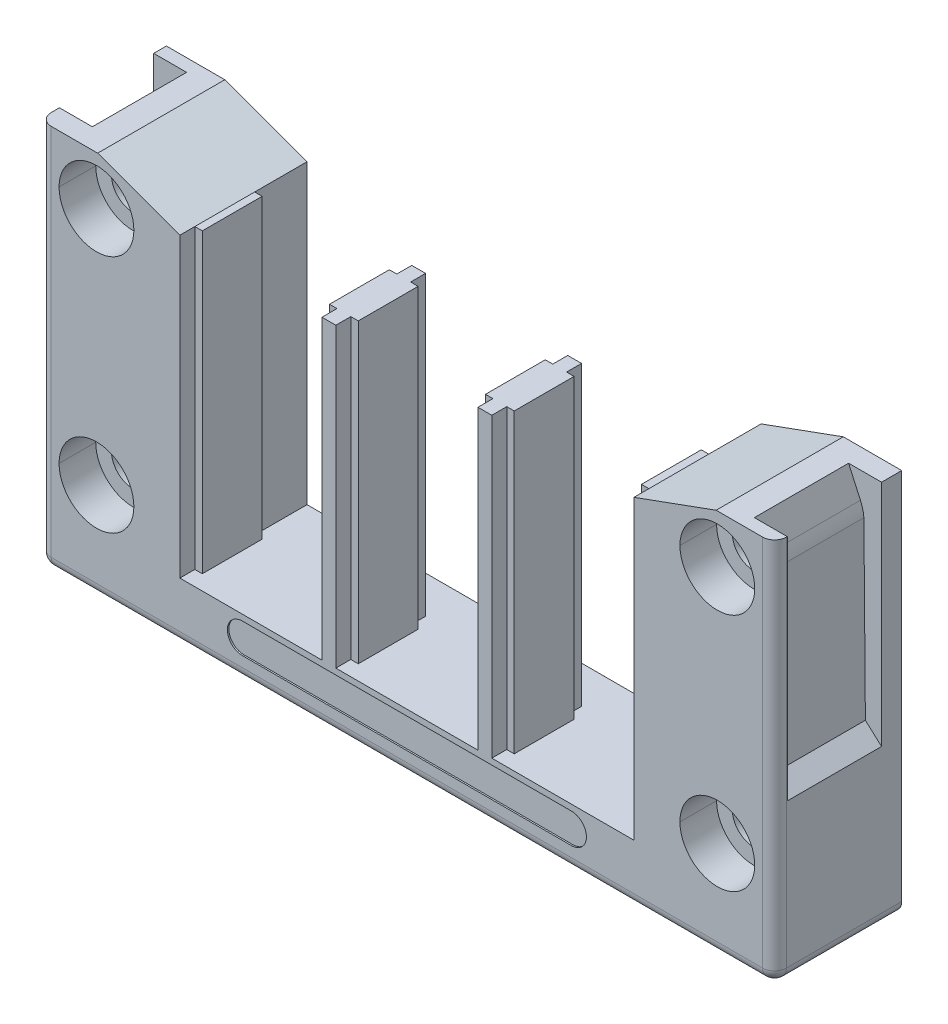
ISO-10303-21;
HEADER;
FILE_DESCRIPTION(('STEP AP214'),'2;1');
FILE_NAME('part.step','',(''),(''),'','','');
FILE_SCHEMA(('AUTOMOTIVE_DESIGN { 1 0 10303 214 1 1 1 1 }'));
ENDSEC;
DATA;
#1=APPLICATION_CONTEXT('core data for automotive mechanical design processes');
#2=APPLICATION_PROTOCOL_DEFINITION('international standard','automotive_design',2000,#1);
#3=PRODUCT_CONTEXT('',#1,'mechanical');
#4=PRODUCT('Part','Part','',(#3));
#5=PRODUCT_RELATED_PRODUCT_CATEGORY('part','',(#4));
#6=PRODUCT_DEFINITION_FORMATION('','',#4);
#7=PRODUCT_DEFINITION_CONTEXT('part definition',#1,'design');
#8=PRODUCT_DEFINITION('design','',#6,#7);
#9=PRODUCT_DEFINITION_SHAPE('','',#8);
#10=(LENGTH_UNIT() NAMED_UNIT(*) SI_UNIT(.MILLI.,.METRE.));
#11=(NAMED_UNIT(*) PLANE_ANGLE_UNIT() SI_UNIT($,.RADIAN.));
#12=(NAMED_UNIT(*) SI_UNIT($,.STERADIAN.) SOLID_ANGLE_UNIT());
#13=UNCERTAINTY_MEASURE_WITH_UNIT(LENGTH_MEASURE(1.E-05),#10,'distance_accuracy_value','');
#14=(GEOMETRIC_REPRESENTATION_CONTEXT(3) GLOBAL_UNCERTAINTY_ASSIGNED_CONTEXT((#13)) GLOBAL_UNIT_ASSIGNED_CONTEXT((#10,
#11,#12)) REPRESENTATION_CONTEXT('',''));
#15=CARTESIAN_POINT('',(0.,0.,0.));
#16=DIRECTION('',(0.,0.,1.));
#17=DIRECTION('',(1.,0.,0.));
#18=AXIS2_PLACEMENT_3D('',#15,#16,#17);
#19=CARTESIAN_POINT('',(-22.,-46.5,8.3));
#20=DIRECTION('',(0.,0.,1.));
#21=DIRECTION('',(1.,0.,0.));
#22=AXIS2_PLACEMENT_3D('',#19,#20,#21);
#23=PLANE('',#22);
#24=CARTESIAN_POINT('',(-22.,-46.5,8.3));
#25=DIRECTION('',(0.,0.,1.));
#26=DIRECTION('',(1.,0.,0.));
#27=AXIS2_PLACEMENT_3D('',#24,#25,#26);
#28=CIRCLE('',#27,2.);
#29=CARTESIAN_POINT('',(-22.,-44.5,8.3));
#30=VERTEX_POINT('',#29);
#31=CARTESIAN_POINT('',(-22.,-48.5,8.3));
#32=VERTEX_POINT('',#31);
#33=EDGE_CURVE('E1130',#30,#32,#28,.T.);
#34=ORIENTED_EDGE('',*,*,#33,.T.);
#35=DIRECTION('',(1.,0.,0.));
#36=VECTOR('',#35,1.);
#37=CARTESIAN_POINT('',(-22.,-48.5,8.3));
#38=LINE('',#37,#36);
#39=CARTESIAN_POINT('',(22.,-48.5,8.3));
#40=VERTEX_POINT('',#39);
#41=EDGE_CURVE('E10',#32,#40,#38,.T.);
#42=ORIENTED_EDGE('',*,*,#41,.T.);
#43=CARTESIAN_POINT('',(22.,-46.5,8.3));
#44=DIRECTION('',(0.,0.,1.));
#45=DIRECTION('',(1.,0.,0.));
#46=AXIS2_PLACEMENT_3D('',#43,#44,#45);
#47=CIRCLE('',#46,2.);
#48=CARTESIAN_POINT('',(24.,-46.5,8.3));
#49=VERTEX_POINT('',#48);
#50=EDGE_CURVE('E1138',#40,#49,#47,.T.);
#51=ORIENTED_EDGE('',*,*,#50,.T.);
#52=CARTESIAN_POINT('',(22.,-46.5,8.3));
#53=DIRECTION('',(0.,0.,1.));
#54=DIRECTION('',(1.,0.,0.));
#55=AXIS2_PLACEMENT_3D('',#52,#53,#54);
#56=CIRCLE('',#55,2.);
#57=CARTESIAN_POINT('',(22.,-44.5,8.3));
#58=VERTEX_POINT('',#57);
#59=EDGE_CURVE('E1169',#49,#58,#56,.T.);
#60=ORIENTED_EDGE('',*,*,#59,.T.);
#61=DIRECTION('',(-1.,0.,0.));
#62=VECTOR('',#61,1.);
#63=CARTESIAN_POINT('',(-22.,-44.5,8.3));
#64=LINE('',#63,#62);
#65=EDGE_CURVE('E40',#58,#30,#64,.T.);
#66=ORIENTED_EDGE('',*,*,#65,.T.);
#67=EDGE_LOOP('',(#34,#42,#51,#60,#66));
#68=FACE_BOUND('',#67,.T.);
#69=ADVANCED_FACE('F15',(#68),#23,.T.);
#70=CARTESIAN_POINT('',(-22.,-48.5,8.3));
#71=DIRECTION('',(0.,-1.,0.));
#72=DIRECTION('',(0.,0.,-1.));
#73=AXIS2_PLACEMENT_3D('',#70,#71,#72);
#74=PLANE('',#73);
#75=DIRECTION('',(1.,0.,0.));
#76=VECTOR('',#75,1.);
#77=CARTESIAN_POINT('',(-22.,-48.5,8.5));
#78=LINE('',#77,#76);
#79=CARTESIAN_POINT('',(-22.,-48.5,8.5));
#80=VERTEX_POINT('',#79);
#81=CARTESIAN_POINT('',(22.,-48.5,8.5));
#82=VERTEX_POINT('',#81);
#83=EDGE_CURVE('E783',#80,#82,#78,.T.);
#84=ORIENTED_EDGE('',*,*,#83,.T.);
#85=DIRECTION('',(0.,0.,1.));
#86=VECTOR('',#85,1.);
#87=CARTESIAN_POINT('',(22.,-48.5,8.3));
#88=LINE('',#87,#86);
#89=EDGE_CURVE('E23',#40,#82,#88,.T.);
#90=ORIENTED_EDGE('',*,*,#89,.F.);
#91=ORIENTED_EDGE('',*,*,#41,.F.);
#92=DIRECTION('',(0.,0.,1.));
#93=VECTOR('',#92,1.);
#94=CARTESIAN_POINT('',(-22.,-48.5,8.3));
#95=LINE('',#94,#93);
#96=EDGE_CURVE('E1127',#32,#80,#95,.T.);
#97=ORIENTED_EDGE('',*,*,#96,.T.);
#98=EDGE_LOOP('',(#84,#90,#91,#97));
#99=FACE_BOUND('',#98,.T.);
#100=ADVANCED_FACE('F1150',(#99),#74,.F.);
#101=CARTESIAN_POINT('',(22.,-46.5,8.3));
#102=DIRECTION('',(0.,0.,1.));
#103=DIRECTION('',(1.,0.,0.));
#104=AXIS2_PLACEMENT_3D('',#101,#102,#103);
#105=CYLINDRICAL_SURFACE('',#104,2.);
#106=DIRECTION('',(0.,0.,1.));
#107=VECTOR('',#106,1.);
#108=CARTESIAN_POINT('',(24.,-46.5,8.3));
#109=LINE('',#108,#107);
#110=CARTESIAN_POINT('',(24.,-46.5,8.5));
#111=VERTEX_POINT('',#110);
#112=EDGE_CURVE('E1170',#49,#111,#109,.T.);
#113=ORIENTED_EDGE('',*,*,#112,.F.);
#114=ORIENTED_EDGE('',*,*,#50,.F.);
#115=ORIENTED_EDGE('',*,*,#89,.T.);
#116=CARTESIAN_POINT('',(22.,-46.5,8.5));
#117=DIRECTION('',(0.,0.,1.));
#118=DIRECTION('',(1.,0.,0.));
#119=AXIS2_PLACEMENT_3D('',#116,#117,#118);
#120=CIRCLE('',#119,2.);
#121=EDGE_CURVE('E788',#82,#111,#120,.T.);
#122=ORIENTED_EDGE('',*,*,#121,.T.);
#123=EDGE_LOOP('',(#113,#114,#115,#122));
#124=FACE_BOUND('',#123,.T.);
#125=ADVANCED_FACE('F1145',(#124),#105,.F.);
#126=CARTESIAN_POINT('',(-22.,-44.5,8.3));
#127=DIRECTION('',(0.,1.,0.));
#128=DIRECTION('',(1.,0.,0.));
#129=AXIS2_PLACEMENT_3D('',#126,#127,#128);
#130=PLANE('',#129);
#131=DIRECTION('',(-1.,0.,0.));
#132=VECTOR('',#131,1.);
#133=CARTESIAN_POINT('',(-22.,-44.5,8.5));
#134=LINE('',#133,#132);
#135=CARTESIAN_POINT('',(22.,-44.5,8.5));
#136=VERTEX_POINT('',#135);
#137=CARTESIAN_POINT('',(-22.,-44.5,8.5));
#138=VERTEX_POINT('',#137);
#139=EDGE_CURVE('E1159',#136,#138,#134,.T.);
#140=ORIENTED_EDGE('',*,*,#139,.T.);
#141=DIRECTION('',(0.,0.,1.));
#142=VECTOR('',#141,1.);
#143=CARTESIAN_POINT('',(-22.,-44.5,8.3));
#144=LINE('',#143,#142);
#145=EDGE_CURVE('E1133',#30,#138,#144,.T.);
#146=ORIENTED_EDGE('',*,*,#145,.F.);
#147=ORIENTED_EDGE('',*,*,#65,.F.);
#148=DIRECTION('',(0.,0.,1.));
#149=VECTOR('',#148,1.);
#150=CARTESIAN_POINT('',(22.,-44.5,8.3));
#151=LINE('',#150,#149);
#152=EDGE_CURVE('E1186',#58,#136,#151,.T.);
#153=ORIENTED_EDGE('',*,*,#152,.T.);
#154=EDGE_LOOP('',(#140,#146,#147,#153));
#155=FACE_BOUND('',#154,.T.);
#156=ADVANCED_FACE('F1723',(#155),#130,.F.);
#157=CARTESIAN_POINT('',(-22.,-46.5,8.3));
#158=DIRECTION('',(0.,0.,1.));
#159=DIRECTION('',(1.,0.,0.));
#160=AXIS2_PLACEMENT_3D('',#157,#158,#159);
#161=CYLINDRICAL_SURFACE('',#160,2.);
#162=CARTESIAN_POINT('',(-22.,-46.5,8.5));
#163=DIRECTION('',(0.,0.,1.));
#164=DIRECTION('',(1.,0.,0.));
#165=AXIS2_PLACEMENT_3D('',#162,#163,#164);
#166=CIRCLE('',#165,2.);
#167=EDGE_CURVE('E781',#138,#80,#166,.T.);
#168=ORIENTED_EDGE('',*,*,#167,.T.);
#169=ORIENTED_EDGE('',*,*,#96,.F.);
#170=ORIENTED_EDGE('',*,*,#33,.F.);
#171=ORIENTED_EDGE('',*,*,#145,.T.);
#172=EDGE_LOOP('',(#168,#169,#170,#171));
#173=FACE_BOUND('',#172,.T.);
#174=ADVANCED_FACE('F1720',(#173),#161,.F.);
#175=CARTESIAN_POINT('',(12.35,-56.3024799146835,-1.5));
#176=DIRECTION('',(0.,0.,1.));
#177=DIRECTION('',(1.,0.,0.));
#178=AXIS2_PLACEMENT_3D('',#175,#176,#177);
#179=PLANE('',#178);
#180=DIRECTION('',(0.,1.,0.));
#181=VECTOR('',#180,1.);
#182=CARTESIAN_POINT('',(12.35,-56.3024799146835,-1.5));
#183=LINE('',#182,#181);
#184=CARTESIAN_POINT('',(12.3500000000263,-43.7,-1.5));
#185=VERTEX_POINT('',#184);
#186=CARTESIAN_POINT('',(12.35,-4.,-1.5));
#187=VERTEX_POINT('',#186);
#188=EDGE_CURVE('E1124',#185,#187,#183,.T.);
#189=ORIENTED_EDGE('',*,*,#188,.F.);
#190=DIRECTION('',(-1.,0.,0.));
#191=VECTOR('',#190,1.);
#192=CARTESIAN_POINT('',(12.35,-43.7,-1.5));
#193=LINE('',#192,#191);
#194=CARTESIAN_POINT('',(11.3499999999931,-43.7,-1.5));
#195=VERTEX_POINT('',#194);
#196=EDGE_CURVE('E1434',#185,#195,#193,.T.);
#197=ORIENTED_EDGE('',*,*,#196,.T.);
#198=DIRECTION('',(0.,1.,0.));
#199=VECTOR('',#198,1.);
#200=CARTESIAN_POINT('',(11.35,-56.3024799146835,-1.5));
#201=LINE('',#200,#199);
#202=CARTESIAN_POINT('',(11.35,-4.,-1.5));
#203=VERTEX_POINT('',#202);
#204=EDGE_CURVE('E1097',#195,#203,#201,.T.);
#205=ORIENTED_EDGE('',*,*,#204,.T.);
#206=DIRECTION('',(1.,0.,0.));
#207=VECTOR('',#206,1.);
#208=CARTESIAN_POINT('',(12.35,-4.,-1.5));
#209=LINE('',#208,#207);
#210=EDGE_CURVE('E1054',#203,#187,#209,.T.);
#211=ORIENTED_EDGE('',*,*,#210,.T.);
#212=EDGE_LOOP('',(#189,#197,#205,#211));
#213=FACE_BOUND('',#212,.T.);
#214=ADVANCED_FACE('F1932',(#213),#179,.F.);
#215=CARTESIAN_POINT('',(12.35,-56.3024799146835,-1.5));
#216=DIRECTION('',(-1.,0.,0.));
#217=DIRECTION('',(0.,1.,0.));
#218=AXIS2_PLACEMENT_3D('',#215,#216,#217);
#219=PLANE('',#218);
#220=DIRECTION('',(0.,1.,0.));
#221=VECTOR('',#220,1.);
#222=CARTESIAN_POINT('',(12.35,-56.3024799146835,6.5));
#223=LINE('',#222,#221);
#224=CARTESIAN_POINT('',(12.3500000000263,-43.7,6.5));
#225=VERTEX_POINT('',#224);
#226=CARTESIAN_POINT('',(12.35,-4.,6.5));
#227=VERTEX_POINT('',#226);
#228=EDGE_CURVE('E1121',#225,#227,#223,.T.);
#229=ORIENTED_EDGE('',*,*,#228,.F.);
#230=DIRECTION('',(0.,0.,-1.));
#231=VECTOR('',#230,1.);
#232=CARTESIAN_POINT('',(12.35,-43.7,-1.5));
#233=LINE('',#232,#231);
#234=EDGE_CURVE('E1438',#225,#185,#233,.T.);
#235=ORIENTED_EDGE('',*,*,#234,.T.);
#236=ORIENTED_EDGE('',*,*,#188,.T.);
#237=DIRECTION('',(0.,0.,1.));
#238=VECTOR('',#237,1.);
#239=CARTESIAN_POINT('',(12.35,-4.,-1.5));
#240=LINE('',#239,#238);
#241=EDGE_CURVE('E1093',#187,#227,#240,.T.);
#242=ORIENTED_EDGE('',*,*,#241,.T.);
#243=EDGE_LOOP('',(#229,#235,#236,#242));
#244=FACE_BOUND('',#243,.T.);
#245=ADVANCED_FACE('F1935',(#244),#219,.F.);
#246=CARTESIAN_POINT('',(12.35,-56.3024799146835,6.5));
#247=DIRECTION('',(0.,0.,-1.));
#248=DIRECTION('',(-1.,0.,0.));
#249=AXIS2_PLACEMENT_3D('',#246,#247,#248);
#250=PLANE('',#249);
#251=DIRECTION('',(0.,1.,0.));
#252=VECTOR('',#251,1.);
#253=CARTESIAN_POINT('',(11.35,-56.3024799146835,6.5));
#254=LINE('',#253,#252);
#255=CARTESIAN_POINT('',(11.3499999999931,-43.7,6.5));
#256=VERTEX_POINT('',#255);
#257=CARTESIAN_POINT('',(11.35,-4.,6.5));
#258=VERTEX_POINT('',#257);
#259=EDGE_CURVE('E1118',#256,#258,#254,.T.);
#260=ORIENTED_EDGE('',*,*,#259,.F.);
#261=DIRECTION('',(1.,0.,0.));
#262=VECTOR('',#261,1.);
#263=CARTESIAN_POINT('',(12.35,-43.7,6.5));
#264=LINE('',#263,#262);
#265=EDGE_CURVE('E1442',#256,#225,#264,.T.);
#266=ORIENTED_EDGE('',*,*,#265,.T.);
#267=ORIENTED_EDGE('',*,*,#228,.T.);
#268=DIRECTION('',(-1.,0.,0.));
#269=VECTOR('',#268,1.);
#270=CARTESIAN_POINT('',(12.35,-4.,6.5));
#271=LINE('',#270,#269);
#272=EDGE_CURVE('E1089',#227,#258,#271,.T.);
#273=ORIENTED_EDGE('',*,*,#272,.T.);
#274=EDGE_LOOP('',(#260,#266,#267,#273));
#275=FACE_BOUND('',#274,.T.);
#276=ADVANCED_FACE('F2634',(#275),#250,.F.);
#277=CARTESIAN_POINT('',(11.35,-56.3024799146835,6.5));
#278=DIRECTION('',(-1.,0.,0.));
#279=DIRECTION('',(0.,0.,1.));
#280=AXIS2_PLACEMENT_3D('',#277,#278,#279);
#281=PLANE('',#280);
#282=DIRECTION('',(0.,1.,0.));
#283=VECTOR('',#282,1.);
#284=CARTESIAN_POINT('',(11.35,-56.3024799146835,8.5));
#285=LINE('',#284,#283);
#286=CARTESIAN_POINT('',(11.35,-43.7,8.5));
#287=VERTEX_POINT('',#286);
#288=CARTESIAN_POINT('',(11.35,-4.,8.5));
#289=VERTEX_POINT('',#288);
#290=EDGE_CURVE('E774',#287,#289,#285,.T.);
#291=ORIENTED_EDGE('',*,*,#290,.F.);
#292=DIRECTION('',(0.,0.,-1.));
#293=VECTOR('',#292,1.);
#294=CARTESIAN_POINT('',(11.35,-43.7,6.5));
#295=LINE('',#294,#293);
#296=EDGE_CURVE('E1446',#287,#256,#295,.T.);
#297=ORIENTED_EDGE('',*,*,#296,.T.);
#298=ORIENTED_EDGE('',*,*,#259,.T.);
#299=DIRECTION('',(0.,0.,1.));
#300=VECTOR('',#299,1.);
#301=CARTESIAN_POINT('',(11.35,-4.,6.5));
#302=LINE('',#301,#300);
#303=EDGE_CURVE('E1086',#258,#289,#302,.T.);
#304=ORIENTED_EDGE('',*,*,#303,.T.);
#305=EDGE_LOOP('',(#291,#297,#298,#304));
#306=FACE_BOUND('',#305,.T.);
#307=ADVANCED_FACE('F1637',(#306),#281,.F.);
#308=CARTESIAN_POINT('',(9.5,-56.3024799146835,6.5));
#309=DIRECTION('',(1.,0.,0.));
#310=DIRECTION('',(0.,1.,0.));
#311=AXIS2_PLACEMENT_3D('',#308,#309,#310);
#312=PLANE('',#311);
#313=DIRECTION('',(0.,1.,0.));
#314=VECTOR('',#313,1.);
#315=CARTESIAN_POINT('',(9.5,-56.3024799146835,6.5));
#316=LINE('',#315,#314);
#317=CARTESIAN_POINT('',(9.50000000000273,-43.7,6.5));
#318=VERTEX_POINT('',#317);
#319=CARTESIAN_POINT('',(9.5,-4.,6.5));
#320=VERTEX_POINT('',#319);
#321=EDGE_CURVE('E1115',#318,#320,#316,.T.);
#322=ORIENTED_EDGE('',*,*,#321,.F.);
#323=DIRECTION('',(0.,0.,1.));
#324=VECTOR('',#323,1.);
#325=CARTESIAN_POINT('',(9.5,-43.7,6.5));
#326=LINE('',#325,#324);
#327=CARTESIAN_POINT('',(9.49999999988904,-43.7,8.5));
#328=VERTEX_POINT('',#327);
#329=EDGE_CURVE('E1311',#318,#328,#326,.T.);
#330=ORIENTED_EDGE('',*,*,#329,.T.);
#331=DIRECTION('',(0.,1.,0.));
#332=VECTOR('',#331,1.);
#333=CARTESIAN_POINT('',(9.5,-56.3024799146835,8.5));
#334=LINE('',#333,#332);
#335=CARTESIAN_POINT('',(9.5,-4.,8.5));
#336=VERTEX_POINT('',#335);
#337=EDGE_CURVE('E773',#328,#336,#334,.T.);
#338=ORIENTED_EDGE('',*,*,#337,.T.);
#339=DIRECTION('',(0.,0.,-1.));
#340=VECTOR('',#339,1.);
#341=CARTESIAN_POINT('',(9.5,-4.,6.5));
#342=LINE('',#341,#340);
#343=EDGE_CURVE('E1082',#336,#320,#342,.T.);
#344=ORIENTED_EDGE('',*,*,#343,.T.);
#345=EDGE_LOOP('',(#322,#330,#338,#344));
#346=FACE_BOUND('',#345,.T.);
#347=ADVANCED_FACE('F1648',(#346),#312,.F.);
#348=CARTESIAN_POINT('',(9.5,-56.3024799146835,6.5));
#349=DIRECTION('',(0.,0.,-1.));
#350=DIRECTION('',(-1.,0.,0.));
#351=AXIS2_PLACEMENT_3D('',#348,#349,#350);
#352=PLANE('',#351);
#353=DIRECTION('',(0.,1.,0.));
#354=VECTOR('',#353,1.);
#355=CARTESIAN_POINT('',(8.5,-56.3024799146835,6.5));
#356=LINE('',#355,#354);
#357=CARTESIAN_POINT('',(8.50000000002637,-43.7,6.5));
#358=VERTEX_POINT('',#357);
#359=CARTESIAN_POINT('',(8.5,-4.,6.5));
#360=VERTEX_POINT('',#359);
#361=EDGE_CURVE('E1112',#358,#360,#356,.T.);
#362=ORIENTED_EDGE('',*,*,#361,.F.);
#363=DIRECTION('',(1.,0.,0.));
#364=VECTOR('',#363,1.);
#365=CARTESIAN_POINT('',(9.5,-43.7,6.5));
#366=LINE('',#365,#364);
#367=EDGE_CURVE('E1306',#358,#318,#366,.T.);
#368=ORIENTED_EDGE('',*,*,#367,.T.);
#369=ORIENTED_EDGE('',*,*,#321,.T.);
#370=DIRECTION('',(-1.,0.,0.));
#371=VECTOR('',#370,1.);
#372=CARTESIAN_POINT('',(9.5,-4.,6.5));
#373=LINE('',#372,#371);
#374=EDGE_CURVE('E1078',#320,#360,#373,.T.);
#375=ORIENTED_EDGE('',*,*,#374,.T.);
#376=EDGE_LOOP('',(#362,#368,#369,#375));
#377=FACE_BOUND('',#376,.T.);
#378=ADVANCED_FACE('F2607',(#377),#352,.F.);
#379=CARTESIAN_POINT('',(8.5,-56.3024799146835,-1.5));
#380=DIRECTION('',(1.,0.,0.));
#381=DIRECTION('',(0.,0.,-1.));
#382=AXIS2_PLACEMENT_3D('',#379,#380,#381);
#383=PLANE('',#382);
#384=DIRECTION('',(0.,1.,0.));
#385=VECTOR('',#384,1.);
#386=CARTESIAN_POINT('',(8.5,-56.3024799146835,-1.5));
#387=LINE('',#386,#385);
#388=CARTESIAN_POINT('',(8.49999999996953,-43.7,-1.5));
#389=VERTEX_POINT('',#388);
#390=CARTESIAN_POINT('',(8.5,-4.,-1.5));
#391=VERTEX_POINT('',#390);
#392=EDGE_CURVE('E1109',#389,#391,#387,.T.);
#393=ORIENTED_EDGE('',*,*,#392,.F.);
#394=DIRECTION('',(0.,0.,1.));
#395=VECTOR('',#394,1.);
#396=CARTESIAN_POINT('',(8.5,-43.7,-1.5));
#397=LINE('',#396,#395);
#398=EDGE_CURVE('E1310',#389,#358,#397,.T.);
#399=ORIENTED_EDGE('',*,*,#398,.T.);
#400=ORIENTED_EDGE('',*,*,#361,.T.);
#401=DIRECTION('',(0.,0.,-1.));
#402=VECTOR('',#401,1.);
#403=CARTESIAN_POINT('',(8.5,-4.,-1.5));
#404=LINE('',#403,#402);
#405=EDGE_CURVE('E1074',#360,#391,#404,.T.);
#406=ORIENTED_EDGE('',*,*,#405,.T.);
#407=EDGE_LOOP('',(#393,#399,#400,#406));
#408=FACE_BOUND('',#407,.T.);
#409=ADVANCED_FACE('F2597',(#408),#383,.F.);
#410=CARTESIAN_POINT('',(9.5,-56.3024799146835,-1.5));
#411=DIRECTION('',(0.,0.,1.));
#412=DIRECTION('',(0.,-1.,0.));
#413=AXIS2_PLACEMENT_3D('',#410,#411,#412);
#414=PLANE('',#413);
#415=DIRECTION('',(0.,1.,0.));
#416=VECTOR('',#415,1.);
#417=CARTESIAN_POINT('',(9.5,-56.3024799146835,-1.5));
#418=LINE('',#417,#416);
#419=CARTESIAN_POINT('',(9.50000000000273,-43.7,-1.5));
#420=VERTEX_POINT('',#419);
#421=CARTESIAN_POINT('',(9.5,-4.,-1.5));
#422=VERTEX_POINT('',#421);
#423=EDGE_CURVE('E1106',#420,#422,#418,.T.);
#424=ORIENTED_EDGE('',*,*,#423,.F.);
#425=DIRECTION('',(-1.,0.,0.));
#426=VECTOR('',#425,1.);
#427=CARTESIAN_POINT('',(9.5,-43.7,-1.5));
#428=LINE('',#427,#426);
#429=EDGE_CURVE('E1414',#420,#389,#428,.T.);
#430=ORIENTED_EDGE('',*,*,#429,.T.);
#431=ORIENTED_EDGE('',*,*,#392,.T.);
#432=DIRECTION('',(1.,0.,0.));
#433=VECTOR('',#432,1.);
#434=CARTESIAN_POINT('',(9.5,-4.,-1.5));
#435=LINE('',#434,#433);
#436=EDGE_CURVE('E1070',#391,#422,#435,.T.);
#437=ORIENTED_EDGE('',*,*,#436,.T.);
#438=EDGE_LOOP('',(#424,#430,#431,#437));
#439=FACE_BOUND('',#438,.T.);
#440=ADVANCED_FACE('F1746',(#439),#414,.F.);
#441=CARTESIAN_POINT('',(9.5,-56.3024799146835,-3.5));
#442=DIRECTION('',(1.,0.,0.));
#443=DIRECTION('',(0.,1.,0.));
#444=AXIS2_PLACEMENT_3D('',#441,#442,#443);
#445=PLANE('',#444);
#446=DIRECTION('',(0.,1.,0.));
#447=VECTOR('',#446,1.);
#448=CARTESIAN_POINT('',(9.5,-56.3024799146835,-3.5));
#449=LINE('',#448,#447);
#450=CARTESIAN_POINT('',(9.50000000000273,-43.7,-3.5));
#451=VERTEX_POINT('',#450);
#452=CARTESIAN_POINT('',(9.5,-4.,-3.5));
#453=VERTEX_POINT('',#452);
#454=EDGE_CURVE('E1103',#451,#453,#449,.T.);
#455=ORIENTED_EDGE('',*,*,#454,.F.);
#456=DIRECTION('',(0.,0.,1.));
#457=VECTOR('',#456,1.);
#458=CARTESIAN_POINT('',(9.5,-43.7,-3.5));
#459=LINE('',#458,#457);
#460=EDGE_CURVE('E1418',#451,#420,#459,.T.);
#461=ORIENTED_EDGE('',*,*,#460,.T.);
#462=ORIENTED_EDGE('',*,*,#423,.T.);
#463=DIRECTION('',(0.,0.,-1.));
#464=VECTOR('',#463,1.);
#465=CARTESIAN_POINT('',(9.5,-4.,-3.5));
#466=LINE('',#465,#464);
#467=EDGE_CURVE('E1066',#422,#453,#466,.T.);
#468=ORIENTED_EDGE('',*,*,#467,.T.);
#469=EDGE_LOOP('',(#455,#461,#462,#468));
#470=FACE_BOUND('',#469,.T.);
#471=ADVANCED_FACE('F1743',(#470),#445,.F.);
#472=CARTESIAN_POINT('',(11.35,-56.3024799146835,-3.5));
#473=DIRECTION('',(0.,0.,1.));
#474=DIRECTION('',(1.,0.,0.));
#475=AXIS2_PLACEMENT_3D('',#472,#473,#474);
#476=PLANE('',#475);
#477=DIRECTION('',(0.,1.,0.));
#478=VECTOR('',#477,1.);
#479=CARTESIAN_POINT('',(11.35,-56.3024799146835,-3.5));
#480=LINE('',#479,#478);
#481=CARTESIAN_POINT('',(11.3499999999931,-43.7,-3.5));
#482=VERTEX_POINT('',#481);
#483=CARTESIAN_POINT('',(11.35,-4.,-3.5));
#484=VERTEX_POINT('',#483);
#485=EDGE_CURVE('E1100',#482,#484,#480,.T.);
#486=ORIENTED_EDGE('',*,*,#485,.F.);
#487=DIRECTION('',(-1.,0.,0.));
#488=VECTOR('',#487,1.);
#489=CARTESIAN_POINT('',(11.35,-43.7,-3.5));
#490=LINE('',#489,#488);
#491=EDGE_CURVE('E1422',#482,#451,#490,.T.);
#492=ORIENTED_EDGE('',*,*,#491,.T.);
#493=ORIENTED_EDGE('',*,*,#454,.T.);
#494=DIRECTION('',(1.,0.,0.));
#495=VECTOR('',#494,1.);
#496=CARTESIAN_POINT('',(11.35,-4.,-3.5));
#497=LINE('',#496,#495);
#498=EDGE_CURVE('E1062',#453,#484,#497,.T.);
#499=ORIENTED_EDGE('',*,*,#498,.T.);
#500=EDGE_LOOP('',(#486,#492,#493,#499));
#501=FACE_BOUND('',#500,.T.);
#502=ADVANCED_FACE('F1745',(#501),#476,.F.);
#503=CARTESIAN_POINT('',(11.35,-56.3024799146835,-3.5));
#504=DIRECTION('',(-1.,0.,0.));
#505=DIRECTION('',(0.,1.,0.));
#506=AXIS2_PLACEMENT_3D('',#503,#504,#505);
#507=PLANE('',#506);
#508=ORIENTED_EDGE('',*,*,#204,.F.);
#509=DIRECTION('',(0.,0.,-1.));
#510=VECTOR('',#509,1.);
#511=CARTESIAN_POINT('',(11.35,-43.7,-3.5));
#512=LINE('',#511,#510);
#513=EDGE_CURVE('E1426',#195,#482,#512,.T.);
#514=ORIENTED_EDGE('',*,*,#513,.T.);
#515=ORIENTED_EDGE('',*,*,#485,.T.);
#516=DIRECTION('',(0.,0.,1.));
#517=VECTOR('',#516,1.);
#518=CARTESIAN_POINT('',(11.35,-4.,-3.5));
#519=LINE('',#518,#517);
#520=EDGE_CURVE('E1058',#484,#203,#519,.T.);
#521=ORIENTED_EDGE('',*,*,#520,.T.);
#522=EDGE_LOOP('',(#508,#514,#515,#521));
#523=FACE_BOUND('',#522,.T.);
#524=ADVANCED_FACE('F1801',(#523),#507,.F.);
#525=CARTESIAN_POINT('',(0.,-4.,0.));
#526=DIRECTION('',(0.,1.,0.));
#527=DIRECTION('',(1.,0.,0.));
#528=AXIS2_PLACEMENT_3D('',#525,#526,#527);
#529=PLANE('',#528);
#530=ORIENTED_EDGE('',*,*,#210,.F.);
#531=ORIENTED_EDGE('',*,*,#520,.F.);
#532=ORIENTED_EDGE('',*,*,#498,.F.);
#533=ORIENTED_EDGE('',*,*,#467,.F.);
#534=ORIENTED_EDGE('',*,*,#436,.F.);
#535=ORIENTED_EDGE('',*,*,#405,.F.);
#536=ORIENTED_EDGE('',*,*,#374,.F.);
#537=ORIENTED_EDGE('',*,*,#343,.F.);
#538=DIRECTION('',(-1.,0.,0.));
#539=VECTOR('',#538,1.);
#540=CARTESIAN_POINT('',(11.35,-4.,8.5));
#541=LINE('',#540,#539);
#542=EDGE_CURVE('E769',#289,#336,#541,.T.);
#543=ORIENTED_EDGE('',*,*,#542,.F.);
#544=ORIENTED_EDGE('',*,*,#303,.F.);
#545=ORIENTED_EDGE('',*,*,#272,.F.);
#546=ORIENTED_EDGE('',*,*,#241,.F.);
#547=EDGE_LOOP('',(#530,#531,#532,#533,#534,#535,#536,#537,#543,#544,#545,#546));
#548=FACE_BOUND('',#547,.T.);
#549=ADVANCED_FACE('F1643',(#548),#529,.T.);
#550=CARTESIAN_POINT('',(-8.5,-56.3024799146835,-1.5));
#551=DIRECTION('',(-1.,0.,0.));
#552=DIRECTION('',(0.,1.,0.));
#553=AXIS2_PLACEMENT_3D('',#550,#551,#552);
#554=PLANE('',#553);
#555=DIRECTION('',(0.,1.,0.));
#556=VECTOR('',#555,1.);
#557=CARTESIAN_POINT('',(-8.5,-56.3024799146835,6.5));
#558=LINE('',#557,#556);
#559=CARTESIAN_POINT('',(-8.50000000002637,-43.7,6.5));
#560=VERTEX_POINT('',#559);
#561=CARTESIAN_POINT('',(-8.5,-4.,6.5));
#562=VERTEX_POINT('',#561);
#563=EDGE_CURVE('E1051',#560,#562,#558,.T.);
#564=ORIENTED_EDGE('',*,*,#563,.F.);
#565=DIRECTION('',(0.,0.,-1.));
#566=VECTOR('',#565,1.);
#567=CARTESIAN_POINT('',(-8.5,-43.7,-1.5));
#568=LINE('',#567,#566);
#569=CARTESIAN_POINT('',(-8.50000000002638,-43.7,-1.5));
#570=VERTEX_POINT('',#569);
#571=EDGE_CURVE('E1305',#560,#570,#568,.T.);
#572=ORIENTED_EDGE('',*,*,#571,.T.);
#573=DIRECTION('',(0.,1.,0.));
#574=VECTOR('',#573,1.);
#575=CARTESIAN_POINT('',(-8.5,-56.3024799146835,-1.5));
#576=LINE('',#575,#574);
#577=CARTESIAN_POINT('',(-8.5,-4.,-1.5));
#578=VERTEX_POINT('',#577);
#579=EDGE_CURVE('E1024',#570,#578,#576,.T.);
#580=ORIENTED_EDGE('',*,*,#579,.T.);
#581=DIRECTION('',(0.,0.,1.));
#582=VECTOR('',#581,1.);
#583=CARTESIAN_POINT('',(-8.5,-4.,-1.5));
#584=LINE('',#583,#582);
#585=EDGE_CURVE('E996',#578,#562,#584,.T.);
#586=ORIENTED_EDGE('',*,*,#585,.T.);
#587=EDGE_LOOP('',(#564,#572,#580,#586));
#588=FACE_BOUND('',#587,.T.);
#589=ADVANCED_FACE('F1795',(#588),#554,.F.);
#590=CARTESIAN_POINT('',(-8.5,-56.3024799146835,6.5));
#591=DIRECTION('',(0.,0.,-1.));
#592=DIRECTION('',(0.,-1.,0.));
#593=AXIS2_PLACEMENT_3D('',#590,#591,#592);
#594=PLANE('',#593);
#595=DIRECTION('',(0.,1.,0.));
#596=VECTOR('',#595,1.);
#597=CARTESIAN_POINT('',(-9.5,-56.3024799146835,6.5));
#598=LINE('',#597,#596);
#599=CARTESIAN_POINT('',(-9.50000000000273,-43.7,6.5));
#600=VERTEX_POINT('',#599);
#601=CARTESIAN_POINT('',(-9.5,-4.,6.5));
#602=VERTEX_POINT('',#601);
#603=EDGE_CURVE('E1048',#600,#602,#598,.T.);
#604=ORIENTED_EDGE('',*,*,#603,.F.);
#605=DIRECTION('',(1.,0.,0.));
#606=VECTOR('',#605,1.);
#607=CARTESIAN_POINT('',(-8.5,-43.7,6.5));
#608=LINE('',#607,#606);
#609=EDGE_CURVE('E1301',#600,#560,#608,.T.);
#610=ORIENTED_EDGE('',*,*,#609,.T.);
#611=ORIENTED_EDGE('',*,*,#563,.T.);
#612=DIRECTION('',(-1.,0.,0.));
#613=VECTOR('',#612,1.);
#614=CARTESIAN_POINT('',(-8.5,-4.,6.5));
#615=LINE('',#614,#613);
#616=EDGE_CURVE('E1020',#562,#602,#615,.T.);
#617=ORIENTED_EDGE('',*,*,#616,.T.);
#618=EDGE_LOOP('',(#604,#610,#611,#617));
#619=FACE_BOUND('',#618,.T.);
#620=ADVANCED_FACE('F1792',(#619),#594,.F.);
#621=CARTESIAN_POINT('',(-9.5,-56.3024799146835,6.5));
#622=DIRECTION('',(-1.,0.,0.));
#623=DIRECTION('',(0.,0.,1.));
#624=AXIS2_PLACEMENT_3D('',#621,#622,#623);
#625=PLANE('',#624);
#626=DIRECTION('',(0.,1.,0.));
#627=VECTOR('',#626,1.);
#628=CARTESIAN_POINT('',(-9.5,-56.3024799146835,8.5));
#629=LINE('',#628,#627);
#630=CARTESIAN_POINT('',(-9.5,-43.7,8.5));
#631=VERTEX_POINT('',#630);
#632=CARTESIAN_POINT('',(-9.5,-4.,8.5));
#633=VERTEX_POINT('',#632);
#634=EDGE_CURVE('E778',#631,#633,#629,.T.);
#635=ORIENTED_EDGE('',*,*,#634,.F.);
#636=DIRECTION('',(0.,0.,-1.));
#637=VECTOR('',#636,1.);
#638=CARTESIAN_POINT('',(-9.5,-43.7,6.5));
#639=LINE('',#638,#637);
#640=EDGE_CURVE('E1177',#631,#600,#639,.T.);
#641=ORIENTED_EDGE('',*,*,#640,.T.);
#642=ORIENTED_EDGE('',*,*,#603,.T.);
#643=DIRECTION('',(0.,0.,1.));
#644=VECTOR('',#643,1.);
#645=CARTESIAN_POINT('',(-9.5,-4.,6.5));
#646=LINE('',#645,#644);
#647=EDGE_CURVE('E1017',#602,#633,#646,.T.);
#648=ORIENTED_EDGE('',*,*,#647,.T.);
#649=EDGE_LOOP('',(#635,#641,#642,#648));
#650=FACE_BOUND('',#649,.T.);
#651=ADVANCED_FACE('F1655',(#650),#625,.F.);
#652=CARTESIAN_POINT('',(-11.35,-56.3024799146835,6.5));
#653=DIRECTION('',(1.,0.,0.));
#654=DIRECTION('',(0.,0.,1.));
#655=AXIS2_PLACEMENT_3D('',#652,#653,#654);
#656=PLANE('',#655);
#657=DIRECTION('',(0.,1.,0.));
#658=VECTOR('',#657,1.);
#659=CARTESIAN_POINT('',(-11.35,-56.3024799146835,6.5));
#660=LINE('',#659,#658);
#661=CARTESIAN_POINT('',(-11.3499999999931,-43.7,6.5));
#662=VERTEX_POINT('',#661);
#663=CARTESIAN_POINT('',(-11.35,-4.,6.5));
#664=VERTEX_POINT('',#663);
#665=EDGE_CURVE('E1045',#662,#664,#660,.T.);
#666=ORIENTED_EDGE('',*,*,#665,.F.);
#667=DIRECTION('',(0.,0.,1.));
#668=VECTOR('',#667,1.);
#669=CARTESIAN_POINT('',(-11.35,-43.7,6.5));
#670=LINE('',#669,#668);
#671=CARTESIAN_POINT('',(-11.3500000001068,-43.7,8.5));
#672=VERTEX_POINT('',#671);
#673=EDGE_CURVE('E1260',#662,#672,#670,.T.);
#674=ORIENTED_EDGE('',*,*,#673,.T.);
#675=DIRECTION('',(0.,1.,0.));
#676=VECTOR('',#675,1.);
#677=CARTESIAN_POINT('',(-11.35,-56.3024799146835,8.5));
#678=LINE('',#677,#676);
#679=CARTESIAN_POINT('',(-11.35,-4.,8.5));
#680=VERTEX_POINT('',#679);
#681=EDGE_CURVE('E782',#672,#680,#678,.T.);
#682=ORIENTED_EDGE('',*,*,#681,.T.);
#683=DIRECTION('',(0.,0.,-1.));
#684=VECTOR('',#683,1.);
#685=CARTESIAN_POINT('',(-11.35,-4.,6.5));
#686=LINE('',#685,#684);
#687=EDGE_CURVE('E748',#680,#664,#686,.T.);
#688=ORIENTED_EDGE('',*,*,#687,.T.);
#689=EDGE_LOOP('',(#666,#674,#682,#688));
#690=FACE_BOUND('',#689,.T.);
#691=ADVANCED_FACE('F1664',(#690),#656,.F.);
#692=CARTESIAN_POINT('',(-11.35,-56.3024799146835,6.5));
#693=DIRECTION('',(0.,0.,-1.));
#694=DIRECTION('',(-1.,0.,0.));
#695=AXIS2_PLACEMENT_3D('',#692,#693,#694);
#696=PLANE('',#695);
#697=DIRECTION('',(0.,1.,0.));
#698=VECTOR('',#697,1.);
#699=CARTESIAN_POINT('',(-12.35,-56.3024799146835,6.5));
#700=LINE('',#699,#698);
#701=CARTESIAN_POINT('',(-12.3500000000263,-43.7,6.5));
#702=VERTEX_POINT('',#701);
#703=CARTESIAN_POINT('',(-12.35,-4.,6.5));
#704=VERTEX_POINT('',#703);
#705=EDGE_CURVE('E1042',#702,#704,#700,.T.);
#706=ORIENTED_EDGE('',*,*,#705,.F.);
#707=DIRECTION('',(1.,0.,0.));
#708=VECTOR('',#707,1.);
#709=CARTESIAN_POINT('',(-11.35,-43.7,6.5));
#710=LINE('',#709,#708);
#711=EDGE_CURVE('E1264',#702,#662,#710,.T.);
#712=ORIENTED_EDGE('',*,*,#711,.T.);
#713=ORIENTED_EDGE('',*,*,#665,.T.);
#714=DIRECTION('',(-1.,0.,0.));
#715=VECTOR('',#714,1.);
#716=CARTESIAN_POINT('',(-11.35,-4.,6.5));
#717=LINE('',#716,#715);
#718=EDGE_CURVE('E744',#664,#704,#717,.T.);
#719=ORIENTED_EDGE('',*,*,#718,.T.);
#720=EDGE_LOOP('',(#706,#712,#713,#719));
#721=FACE_BOUND('',#720,.T.);
#722=ADVANCED_FACE('F2556',(#721),#696,.F.);
#723=CARTESIAN_POINT('',(-12.35,-56.3024799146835,-1.5));
#724=DIRECTION('',(1.,0.,0.));
#725=DIRECTION('',(0.,0.,-1.));
#726=AXIS2_PLACEMENT_3D('',#723,#724,#725);
#727=PLANE('',#726);
#728=DIRECTION('',(0.,1.,0.));
#729=VECTOR('',#728,1.);
#730=CARTESIAN_POINT('',(-12.35,-56.3024799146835,-1.5));
#731=LINE('',#730,#729);
#732=CARTESIAN_POINT('',(-12.3500000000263,-43.7,-1.5));
#733=VERTEX_POINT('',#732);
#734=CARTESIAN_POINT('',(-12.35,-4.,-1.5));
#735=VERTEX_POINT('',#734);
#736=EDGE_CURVE('E1039',#733,#735,#731,.T.);
#737=ORIENTED_EDGE('',*,*,#736,.F.);
#738=DIRECTION('',(0.,0.,1.));
#739=VECTOR('',#738,1.);
#740=CARTESIAN_POINT('',(-12.35,-43.7,-1.5));
#741=LINE('',#740,#739);
#742=EDGE_CURVE('E1371',#733,#702,#741,.T.);
#743=ORIENTED_EDGE('',*,*,#742,.T.);
#744=ORIENTED_EDGE('',*,*,#705,.T.);
#745=DIRECTION('',(0.,0.,-1.));
#746=VECTOR('',#745,1.);
#747=CARTESIAN_POINT('',(-12.35,-4.,-1.5));
#748=LINE('',#747,#746);
#749=EDGE_CURVE('E749',#704,#735,#748,.T.);
#750=ORIENTED_EDGE('',*,*,#749,.T.);
#751=EDGE_LOOP('',(#737,#743,#744,#750));
#752=FACE_BOUND('',#751,.T.);
#753=ADVANCED_FACE('F2546',(#752),#727,.F.);
#754=CARTESIAN_POINT('',(-11.35,-56.3024799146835,-1.5));
#755=DIRECTION('',(0.,0.,1.));
#756=DIRECTION('',(1.,0.,0.));
#757=AXIS2_PLACEMENT_3D('',#754,#755,#756);
#758=PLANE('',#757);
#759=DIRECTION('',(0.,1.,0.));
#760=VECTOR('',#759,1.);
#761=CARTESIAN_POINT('',(-11.35,-56.3024799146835,-1.5));
#762=LINE('',#761,#760);
#763=CARTESIAN_POINT('',(-11.3499999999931,-43.7,-1.5));
#764=VERTEX_POINT('',#763);
#765=CARTESIAN_POINT('',(-11.35,-4.,-1.5));
#766=VERTEX_POINT('',#765);
#767=EDGE_CURVE('E1036',#764,#766,#762,.T.);
#768=ORIENTED_EDGE('',*,*,#767,.F.);
#769=DIRECTION('',(-1.,0.,0.));
#770=VECTOR('',#769,1.);
#771=CARTESIAN_POINT('',(-11.35,-43.7,-1.5));
#772=LINE('',#771,#770);
#773=EDGE_CURVE('E1507',#764,#733,#772,.T.);
#774=ORIENTED_EDGE('',*,*,#773,.T.);
#775=ORIENTED_EDGE('',*,*,#736,.T.);
#776=DIRECTION('',(1.,0.,0.));
#777=VECTOR('',#776,1.);
#778=CARTESIAN_POINT('',(-11.35,-4.,-1.5));
#779=LINE('',#778,#777);
#780=EDGE_CURVE('E1010',#735,#766,#779,.T.);
#781=ORIENTED_EDGE('',*,*,#780,.T.);
#782=EDGE_LOOP('',(#768,#774,#775,#781));
#783=FACE_BOUND('',#782,.T.);
#784=ADVANCED_FACE('F1925',(#783),#758,.F.);
#785=CARTESIAN_POINT('',(-11.35,-56.3024799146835,-3.5));
#786=DIRECTION('',(1.,0.,0.));
#787=DIRECTION('',(0.,0.,-1.));
#788=AXIS2_PLACEMENT_3D('',#785,#786,#787);
#789=PLANE('',#788);
#790=DIRECTION('',(0.,1.,0.));
#791=VECTOR('',#790,1.);
#792=CARTESIAN_POINT('',(-11.35,-56.3024799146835,-3.5));
#793=LINE('',#792,#791);
#794=CARTESIAN_POINT('',(-11.3499999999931,-43.7,-3.5));
#795=VERTEX_POINT('',#794);
#796=CARTESIAN_POINT('',(-11.35,-4.,-3.5));
#797=VERTEX_POINT('',#796);
#798=EDGE_CURVE('E1033',#795,#797,#793,.T.);
#799=ORIENTED_EDGE('',*,*,#798,.F.);
#800=DIRECTION('',(0.,0.,1.));
#801=VECTOR('',#800,1.);
#802=CARTESIAN_POINT('',(-11.35,-43.7,-3.5));
#803=LINE('',#802,#801);
#804=EDGE_CURVE('E1511',#795,#764,#803,.T.);
#805=ORIENTED_EDGE('',*,*,#804,.T.);
#806=ORIENTED_EDGE('',*,*,#767,.T.);
#807=DIRECTION('',(0.,0.,-1.));
#808=VECTOR('',#807,1.);
#809=CARTESIAN_POINT('',(-11.35,-4.,-3.5));
#810=LINE('',#809,#808);
#811=EDGE_CURVE('E1006',#766,#797,#810,.T.);
#812=ORIENTED_EDGE('',*,*,#811,.T.);
#813=EDGE_LOOP('',(#799,#805,#806,#812));
#814=FACE_BOUND('',#813,.T.);
#815=ADVANCED_FACE('F1880',(#814),#789,.F.);
#816=CARTESIAN_POINT('',(-9.5,-56.3024799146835,-3.5));
#817=DIRECTION('',(0.,0.,1.));
#818=DIRECTION('',(1.,0.,0.));
#819=AXIS2_PLACEMENT_3D('',#816,#817,#818);
#820=PLANE('',#819);
#821=DIRECTION('',(0.,1.,0.));
#822=VECTOR('',#821,1.);
#823=CARTESIAN_POINT('',(-9.5,-56.3024799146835,-3.5));
#824=LINE('',#823,#822);
#825=CARTESIAN_POINT('',(-9.50000000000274,-43.7,-3.5));
#826=VERTEX_POINT('',#825);
#827=CARTESIAN_POINT('',(-9.5,-4.,-3.5));
#828=VERTEX_POINT('',#827);
#829=EDGE_CURVE('E1030',#826,#828,#824,.T.);
#830=ORIENTED_EDGE('',*,*,#829,.F.);
#831=DIRECTION('',(-1.,0.,0.));
#832=VECTOR('',#831,1.);
#833=CARTESIAN_POINT('',(-9.5,-43.7,-3.5));
#834=LINE('',#833,#832);
#835=EDGE_CURVE('E1515',#826,#795,#834,.T.);
#836=ORIENTED_EDGE('',*,*,#835,.T.);
#837=ORIENTED_EDGE('',*,*,#798,.T.);
#838=DIRECTION('',(1.,0.,0.));
#839=VECTOR('',#838,1.);
#840=CARTESIAN_POINT('',(-9.5,-4.,-3.5));
#841=LINE('',#840,#839);
#842=EDGE_CURVE('E757',#797,#828,#841,.T.);
#843=ORIENTED_EDGE('',*,*,#842,.T.);
#844=EDGE_LOOP('',(#830,#836,#837,#843));
#845=FACE_BOUND('',#844,.T.);
#846=ADVANCED_FACE('F1876',(#845),#820,.F.);
#847=CARTESIAN_POINT('',(-9.5,-56.3024799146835,-3.5));
#848=DIRECTION('',(-1.,0.,0.));
#849=DIRECTION('',(0.,1.,0.));
#850=AXIS2_PLACEMENT_3D('',#847,#848,#849);
#851=PLANE('',#850);
#852=DIRECTION('',(0.,1.,0.));
#853=VECTOR('',#852,1.);
#854=CARTESIAN_POINT('',(-9.5,-56.3024799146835,-1.5));
#855=LINE('',#854,#853);
#856=CARTESIAN_POINT('',(-9.50000000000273,-43.7,-1.5));
#857=VERTEX_POINT('',#856);
#858=CARTESIAN_POINT('',(-9.5,-4.,-1.5));
#859=VERTEX_POINT('',#858);
#860=EDGE_CURVE('E1027',#857,#859,#855,.T.);
#861=ORIENTED_EDGE('',*,*,#860,.F.);
#862=DIRECTION('',(0.,0.,-1.));
#863=VECTOR('',#862,1.);
#864=CARTESIAN_POINT('',(-9.5,-43.7,-3.5));
#865=LINE('',#864,#863);
#866=EDGE_CURVE('E1519',#857,#826,#865,.T.);
#867=ORIENTED_EDGE('',*,*,#866,.T.);
#868=ORIENTED_EDGE('',*,*,#829,.T.);
#869=DIRECTION('',(0.,0.,1.));
#870=VECTOR('',#869,1.);
#871=CARTESIAN_POINT('',(-9.5,-4.,-3.5));
#872=LINE('',#871,#870);
#873=EDGE_CURVE('E753',#828,#859,#872,.T.);
#874=ORIENTED_EDGE('',*,*,#873,.T.);
#875=EDGE_LOOP('',(#861,#867,#868,#874));
#876=FACE_BOUND('',#875,.T.);
#877=ADVANCED_FACE('F1879',(#876),#851,.F.);
#878=CARTESIAN_POINT('',(-8.5,-56.3024799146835,-1.5));
#879=DIRECTION('',(0.,0.,1.));
#880=DIRECTION('',(1.,0.,0.));
#881=AXIS2_PLACEMENT_3D('',#878,#879,#880);
#882=PLANE('',#881);
#883=ORIENTED_EDGE('',*,*,#579,.F.);
#884=DIRECTION('',(-1.,0.,0.));
#885=VECTOR('',#884,1.);
#886=CARTESIAN_POINT('',(-8.5,-43.7,-1.5));
#887=LINE('',#886,#885);
#888=EDGE_CURVE('E1404',#570,#857,#887,.T.);
#889=ORIENTED_EDGE('',*,*,#888,.T.);
#890=ORIENTED_EDGE('',*,*,#860,.T.);
#891=DIRECTION('',(1.,0.,0.));
#892=VECTOR('',#891,1.);
#893=CARTESIAN_POINT('',(-8.5,-4.,-1.5));
#894=LINE('',#893,#892);
#895=EDGE_CURVE('E758',#859,#578,#894,.T.);
#896=ORIENTED_EDGE('',*,*,#895,.T.);
#897=EDGE_LOOP('',(#883,#889,#890,#896));
#898=FACE_BOUND('',#897,.T.);
#899=ADVANCED_FACE('F1755',(#898),#882,.F.);
#900=CARTESIAN_POINT('',(0.,-4.,0.));
#901=DIRECTION('',(0.,-1.,0.));
#902=DIRECTION('',(0.,0.,-1.));
#903=AXIS2_PLACEMENT_3D('',#900,#901,#902);
#904=PLANE('',#903);
#905=ORIENTED_EDGE('',*,*,#585,.F.);
#906=ORIENTED_EDGE('',*,*,#895,.F.);
#907=ORIENTED_EDGE('',*,*,#873,.F.);
#908=ORIENTED_EDGE('',*,*,#842,.F.);
#909=ORIENTED_EDGE('',*,*,#811,.F.);
#910=ORIENTED_EDGE('',*,*,#780,.F.);
#911=ORIENTED_EDGE('',*,*,#749,.F.);
#912=ORIENTED_EDGE('',*,*,#718,.F.);
#913=ORIENTED_EDGE('',*,*,#687,.F.);
#914=DIRECTION('',(-1.,0.,0.));
#915=VECTOR('',#914,1.);
#916=CARTESIAN_POINT('',(-9.5,-4.,8.5));
#917=LINE('',#916,#915);
#918=EDGE_CURVE('E1430',#633,#680,#917,.T.);
#919=ORIENTED_EDGE('',*,*,#918,.F.);
#920=ORIENTED_EDGE('',*,*,#647,.F.);
#921=ORIENTED_EDGE('',*,*,#616,.F.);
#922=EDGE_LOOP('',(#905,#906,#907,#908,#909,#910,#911,#912,#913,#919,#920,#921));
#923=FACE_BOUND('',#922,.T.);
#924=ADVANCED_FACE('F1660',(#923),#904,.F.);
#925=CARTESIAN_POINT('',(29.35,-56.3024799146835,-1.50000000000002));
#926=DIRECTION('',(0.,0.,1.));
#927=DIRECTION('',(1.,0.,0.));
#928=AXIS2_PLACEMENT_3D('',#925,#926,#927);
#929=PLANE('',#928);
#930=DIRECTION('',(0.,1.,0.));
#931=VECTOR('',#930,1.);
#932=CARTESIAN_POINT('',(30.35,-56.3024799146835,-1.50000000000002));
#933=LINE('',#932,#931);
#934=CARTESIAN_POINT('',(30.3499999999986,-43.7,-1.50000000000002));
#935=VERTEX_POINT('',#934);
#936=CARTESIAN_POINT('',(30.35,-4.,-1.5));
#937=VERTEX_POINT('',#936);
#938=EDGE_CURVE('E1256',#935,#937,#933,.T.);
#939=ORIENTED_EDGE('',*,*,#938,.F.);
#940=DIRECTION('',(-1.,0.,0.));
#941=VECTOR('',#940,1.);
#942=CARTESIAN_POINT('',(29.35,-43.7,-1.50000000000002));
#943=LINE('',#942,#941);
#944=CARTESIAN_POINT('',(29.3499999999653,-43.7,-1.50000000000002));
#945=VERTEX_POINT('',#944);
#946=EDGE_CURVE('E1210',#935,#945,#943,.T.);
#947=ORIENTED_EDGE('',*,*,#946,.T.);
#948=DIRECTION('',(0.,1.,0.));
#949=VECTOR('',#948,1.);
#950=CARTESIAN_POINT('',(29.35,-56.3024799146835,-1.50000000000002));
#951=LINE('',#950,#949);
#952=CARTESIAN_POINT('',(29.35,-4.,-1.5));
#953=VERTEX_POINT('',#952);
#954=EDGE_CURVE('E990',#945,#953,#951,.T.);
#955=ORIENTED_EDGE('',*,*,#954,.T.);
#956=DIRECTION('',(1.,0.,0.));
#957=VECTOR('',#956,1.);
#958=CARTESIAN_POINT('',(29.35,-4.,-1.5));
#959=LINE('',#958,#957);
#960=EDGE_CURVE('E979',#953,#937,#959,.T.);
#961=ORIENTED_EDGE('',*,*,#960,.T.);
#962=EDGE_LOOP('',(#939,#947,#955,#961));
#963=FACE_BOUND('',#962,.T.);
#964=ADVANCED_FACE('F1699',(#963),#929,.F.);
#965=CARTESIAN_POINT('',(29.35,-56.3024799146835,6.5));
#966=DIRECTION('',(0.,0.,-1.));
#967=DIRECTION('',(-1.,0.,0.));
#968=AXIS2_PLACEMENT_3D('',#965,#966,#967);
#969=PLANE('',#968);
#970=DIRECTION('',(0.,1.,0.));
#971=VECTOR('',#970,1.);
#972=CARTESIAN_POINT('',(29.35,-56.3024799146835,6.5));
#973=LINE('',#972,#971);
#974=CARTESIAN_POINT('',(29.3500000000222,-43.7,6.5));
#975=VERTEX_POINT('',#974);
#976=CARTESIAN_POINT('',(29.35,-4.,6.5));
#977=VERTEX_POINT('',#976);
#978=EDGE_CURVE('E993',#975,#977,#973,.T.);
#979=ORIENTED_EDGE('',*,*,#978,.F.);
#980=DIRECTION('',(1.,0.,0.));
#981=VECTOR('',#980,1.);
#982=CARTESIAN_POINT('',(29.35,-43.7,6.5));
#983=LINE('',#982,#981);
#984=CARTESIAN_POINT('',(30.3499999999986,-43.7,6.5));
#985=VERTEX_POINT('',#984);
#986=EDGE_CURVE('E1458',#975,#985,#983,.T.);
#987=ORIENTED_EDGE('',*,*,#986,.T.);
#988=DIRECTION('',(0.,1.,0.));
#989=VECTOR('',#988,1.);
#990=CARTESIAN_POINT('',(30.35,-56.3024799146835,6.5));
#991=LINE('',#990,#989);
#992=CARTESIAN_POINT('',(30.35,-4.,6.5));
#993=VERTEX_POINT('',#992);
#994=EDGE_CURVE('E1172',#985,#993,#991,.T.);
#995=ORIENTED_EDGE('',*,*,#994,.T.);
#996=DIRECTION('',(-1.,0.,0.));
#997=VECTOR('',#996,1.);
#998=CARTESIAN_POINT('',(29.35,-4.,6.5));
#999=LINE('',#998,#997);
#1000=EDGE_CURVE('E986',#993,#977,#999,.T.);
#1001=ORIENTED_EDGE('',*,*,#1000,.T.);
#1002=EDGE_LOOP('',(#979,#987,#995,#1001));
#1003=FACE_BOUND('',#1002,.T.);
#1004=ADVANCED_FACE('F1694',(#1003),#969,.F.);
#1005=CARTESIAN_POINT('',(29.35,-56.3024799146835,-1.50000000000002));
#1006=DIRECTION('',(1.,0.,0.));
#1007=DIRECTION('',(0.,1.,0.));
#1008=AXIS2_PLACEMENT_3D('',#1005,#1006,#1007);
#1009=PLANE('',#1008);
#1010=ORIENTED_EDGE('',*,*,#954,.F.);
#1011=DIRECTION('',(0.,0.,1.));
#1012=VECTOR('',#1011,1.);
#1013=CARTESIAN_POINT('',(29.35,-43.7,-1.50000000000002));
#1014=LINE('',#1013,#1012);
#1015=EDGE_CURVE('E1215',#945,#975,#1014,.T.);
#1016=ORIENTED_EDGE('',*,*,#1015,.T.);
#1017=ORIENTED_EDGE('',*,*,#978,.T.);
#1018=DIRECTION('',(0.,0.,-1.));
#1019=VECTOR('',#1018,1.);
#1020=CARTESIAN_POINT('',(29.35,-4.,-1.5));
#1021=LINE('',#1020,#1019);
#1022=EDGE_CURVE('E982',#977,#953,#1021,.T.);
#1023=ORIENTED_EDGE('',*,*,#1022,.T.);
#1024=EDGE_LOOP('',(#1010,#1016,#1017,#1023));
#1025=FACE_BOUND('',#1024,.T.);
#1026=ADVANCED_FACE('F1697',(#1025),#1009,.F.);
#1027=CARTESIAN_POINT('',(0.,-4.,0.));
#1028=DIRECTION('',(0.,-1.,0.));
#1029=DIRECTION('',(0.,0.,-1.));
#1030=AXIS2_PLACEMENT_3D('',#1027,#1028,#1029);
#1031=PLANE('',#1030);
#1032=ORIENTED_EDGE('',*,*,#960,.F.);
#1033=ORIENTED_EDGE('',*,*,#1022,.F.);
#1034=ORIENTED_EDGE('',*,*,#1000,.F.);
#1035=DIRECTION('',(0.,0.,1.));
#1036=VECTOR('',#1035,1.);
#1037=CARTESIAN_POINT('',(30.35,-4.,-1.5));
#1038=LINE('',#1037,#1036);
#1039=EDGE_CURVE('E881',#937,#993,#1038,.T.);
#1040=ORIENTED_EDGE('',*,*,#1039,.F.);
#1041=EDGE_LOOP('',(#1032,#1033,#1034,#1040));
#1042=FACE_BOUND('',#1041,.T.);
#1043=ADVANCED_FACE('F1700',(#1042),#1031,.F.);
#1044=CARTESIAN_POINT('',(-30.35,-56.3024799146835,-1.5));
#1045=DIRECTION('',(0.,0.,1.));
#1046=DIRECTION('',(1.,0.,0.));
#1047=AXIS2_PLACEMENT_3D('',#1044,#1045,#1046);
#1048=PLANE('',#1047);
#1049=DIRECTION('',(0.,1.,0.));
#1050=VECTOR('',#1049,1.);
#1051=CARTESIAN_POINT('',(-29.35,-56.3024799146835,-1.5));
#1052=LINE('',#1051,#1050);
#1053=CARTESIAN_POINT('',(-29.3499999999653,-43.7,-1.5));
#1054=VERTEX_POINT('',#1053);
#1055=CARTESIAN_POINT('',(-29.35,-4.,-1.5));
#1056=VERTEX_POINT('',#1055);
#1057=EDGE_CURVE('E976',#1054,#1056,#1052,.T.);
#1058=ORIENTED_EDGE('',*,*,#1057,.F.);
#1059=DIRECTION('',(-1.,0.,0.));
#1060=VECTOR('',#1059,1.);
#1061=CARTESIAN_POINT('',(-30.35,-43.7,-1.5));
#1062=LINE('',#1061,#1060);
#1063=CARTESIAN_POINT('',(-30.35,-43.7,-1.5));
#1064=VERTEX_POINT('',#1063);
#1065=EDGE_CURVE('E1483',#1054,#1064,#1062,.T.);
#1066=ORIENTED_EDGE('',*,*,#1065,.T.);
#1067=DIRECTION('',(0.,1.,0.));
#1068=VECTOR('',#1067,1.);
#1069=CARTESIAN_POINT('',(-30.35,-56.3024799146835,-1.5));
#1070=LINE('',#1069,#1068);
#1071=CARTESIAN_POINT('',(-30.35,-4.,-1.5));
#1072=VERTEX_POINT('',#1071);
#1073=EDGE_CURVE('E1459',#1064,#1072,#1070,.T.);
#1074=ORIENTED_EDGE('',*,*,#1073,.T.);
#1075=DIRECTION('',(1.,0.,0.));
#1076=VECTOR('',#1075,1.);
#1077=CARTESIAN_POINT('',(-30.35,-4.,-1.5));
#1078=LINE('',#1077,#1076);
#1079=EDGE_CURVE('E968',#1072,#1056,#1078,.T.);
#1080=ORIENTED_EDGE('',*,*,#1079,.T.);
#1081=EDGE_LOOP('',(#1058,#1066,#1074,#1080));
#1082=FACE_BOUND('',#1081,.T.);
#1083=ADVANCED_FACE('F1702',(#1082),#1048,.F.);
#1084=CARTESIAN_POINT('',(-29.35,-56.3024799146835,-1.5));
#1085=DIRECTION('',(-1.,0.,0.));
#1086=DIRECTION('',(0.,1.,0.));
#1087=AXIS2_PLACEMENT_3D('',#1084,#1085,#1086);
#1088=PLANE('',#1087);
#1089=DIRECTION('',(0.,1.,0.));
#1090=VECTOR('',#1089,1.);
#1091=CARTESIAN_POINT('',(-29.35,-56.3024799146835,6.5));
#1092=LINE('',#1091,#1090);
#1093=CARTESIAN_POINT('',(-29.35,-43.7,6.5));
#1094=VERTEX_POINT('',#1093);
#1095=CARTESIAN_POINT('',(-29.35,-4.,6.5));
#1096=VERTEX_POINT('',#1095);
#1097=EDGE_CURVE('E841',#1094,#1096,#1092,.T.);
#1098=ORIENTED_EDGE('',*,*,#1097,.F.);
#1099=DIRECTION('',(0.,0.,-1.));
#1100=VECTOR('',#1099,1.);
#1101=CARTESIAN_POINT('',(-29.35,-43.7,-1.5));
#1102=LINE('',#1101,#1100);
#1103=EDGE_CURVE('E1487',#1094,#1054,#1102,.T.);
#1104=ORIENTED_EDGE('',*,*,#1103,.T.);
#1105=ORIENTED_EDGE('',*,*,#1057,.T.);
#1106=DIRECTION('',(0.,0.,1.));
#1107=VECTOR('',#1106,1.);
#1108=CARTESIAN_POINT('',(-29.35,-4.,-1.5));
#1109=LINE('',#1108,#1107);
#1110=EDGE_CURVE('E837',#1056,#1096,#1109,.T.);
#1111=ORIENTED_EDGE('',*,*,#1110,.T.);
#1112=EDGE_LOOP('',(#1098,#1104,#1105,#1111));
#1113=FACE_BOUND('',#1112,.T.);
#1114=ADVANCED_FACE('F1709',(#1113),#1088,.F.);
#1115=CARTESIAN_POINT('',(-30.35,-56.3024799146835,6.5));
#1116=DIRECTION('',(0.,0.,-1.));
#1117=DIRECTION('',(0.,-1.,0.));
#1118=AXIS2_PLACEMENT_3D('',#1115,#1116,#1117);
#1119=PLANE('',#1118);
#1120=DIRECTION('',(0.,1.,0.));
#1121=VECTOR('',#1120,1.);
#1122=CARTESIAN_POINT('',(-30.35,-56.3024799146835,6.5));
#1123=LINE('',#1122,#1121);
#1124=CARTESIAN_POINT('',(-30.35,-43.7,6.5));
#1125=VERTEX_POINT('',#1124);
#1126=CARTESIAN_POINT('',(-30.35,-4.,6.5));
#1127=VERTEX_POINT('',#1126);
#1128=EDGE_CURVE('E1239',#1125,#1127,#1123,.T.);
#1129=ORIENTED_EDGE('',*,*,#1128,.F.);
#1130=DIRECTION('',(1.,0.,0.));
#1131=VECTOR('',#1130,1.);
#1132=CARTESIAN_POINT('',(-30.35,-43.7,6.5));
#1133=LINE('',#1132,#1131);
#1134=EDGE_CURVE('E1494',#1125,#1094,#1133,.T.);
#1135=ORIENTED_EDGE('',*,*,#1134,.T.);
#1136=ORIENTED_EDGE('',*,*,#1097,.T.);
#1137=DIRECTION('',(-1.,0.,0.));
#1138=VECTOR('',#1137,1.);
#1139=CARTESIAN_POINT('',(-30.35,-4.,6.5));
#1140=LINE('',#1139,#1138);
#1141=EDGE_CURVE('E842',#1096,#1127,#1140,.T.);
#1142=ORIENTED_EDGE('',*,*,#1141,.T.);
#1143=EDGE_LOOP('',(#1129,#1135,#1136,#1142));
#1144=FACE_BOUND('',#1143,.T.);
#1145=ADVANCED_FACE('F1944',(#1144),#1119,.F.);
#1146=CARTESIAN_POINT('',(0.,-4.,0.));
#1147=DIRECTION('',(0.,-1.,0.));
#1148=DIRECTION('',(0.,0.,-1.));
#1149=AXIS2_PLACEMENT_3D('',#1146,#1147,#1148);
#1150=PLANE('',#1149);
#1151=ORIENTED_EDGE('',*,*,#1079,.F.);
#1152=DIRECTION('',(0.,0.,-1.));
#1153=VECTOR('',#1152,1.);
#1154=CARTESIAN_POINT('',(-30.35,-4.,-1.5));
#1155=LINE('',#1154,#1153);
#1156=EDGE_CURVE('E809',#1127,#1072,#1155,.T.);
#1157=ORIENTED_EDGE('',*,*,#1156,.F.);
#1158=ORIENTED_EDGE('',*,*,#1141,.F.);
#1159=ORIENTED_EDGE('',*,*,#1110,.F.);
#1160=EDGE_LOOP('',(#1151,#1157,#1158,#1159));
#1161=FACE_BOUND('',#1160,.T.);
#1162=ADVANCED_FACE('F1940',(#1161),#1150,.F.);
#1163=CARTESIAN_POINT('',(-47.55,-49.9,-8.5));
#1164=DIRECTION('',(0.,0.,1.));
#1165=DIRECTION('',(1.,0.,0.));
#1166=AXIS2_PLACEMENT_3D('',#1163,#1164,#1165);
#1167=CYLINDRICAL_SURFACE('',#1166,1.6);
#1168=CARTESIAN_POINT('',(-47.55,-49.9,-8.5));
#1169=DIRECTION('',(0.,0.,-1.));
#1170=DIRECTION('',(1.,0.,0.));
#1171=AXIS2_PLACEMENT_3D('',#1168,#1169,#1170);
#1172=CIRCLE('',#1171,1.6);
#1173=CARTESIAN_POINT('',(-47.55,-51.5,-8.5));
#1174=VERTEX_POINT('',#1173);
#1175=CARTESIAN_POINT('',(-49.15,-49.9,-8.5));
#1176=VERTEX_POINT('',#1175);
#1177=EDGE_CURVE('E720',#1174,#1176,#1172,.T.);
#1178=ORIENTED_EDGE('',*,*,#1177,.F.);
#1179=DIRECTION('',(0.,0.,-1.));
#1180=VECTOR('',#1179,1.);
#1181=CARTESIAN_POINT('',(-47.55,-51.5,-8.5));
#1182=LINE('',#1181,#1180);
#1183=CARTESIAN_POINT('',(-47.55,-51.5,6.9));
#1184=VERTEX_POINT('',#1183);
#1185=EDGE_CURVE('E802',#1184,#1174,#1182,.T.);
#1186=ORIENTED_EDGE('',*,*,#1185,.F.);
#1187=CARTESIAN_POINT('',(-47.55,-49.9,6.9));
#1188=DIRECTION('',(0.,0.,-1.));
#1189=DIRECTION('',(1.,0.,0.));
#1190=AXIS2_PLACEMENT_3D('',#1187,#1188,#1189);
#1191=CIRCLE('',#1190,1.6);
#1192=CARTESIAN_POINT('',(-49.15,-49.9,6.9));
#1193=VERTEX_POINT('',#1192);
#1194=EDGE_CURVE('E965',#1184,#1193,#1191,.T.);
#1195=ORIENTED_EDGE('',*,*,#1194,.T.);
#1196=DIRECTION('',(0.,0.,1.));
#1197=VECTOR('',#1196,1.);
#1198=CARTESIAN_POINT('',(-49.15,-49.9,-8.5));
#1199=LINE('',#1198,#1197);
#1200=EDGE_CURVE('E1549',#1176,#1193,#1199,.T.);
#1201=ORIENTED_EDGE('',*,*,#1200,.F.);
#1202=EDGE_LOOP('',(#1178,#1186,#1195,#1201));
#1203=FACE_BOUND('',#1202,.T.);
#1204=ADVANCED_FACE('F1604',(#1203),#1167,.T.);
#1205=CARTESIAN_POINT('',(-47.55,-49.9,6.9));
#1206=DIRECTION('',(0.,1.,0.));
#1207=DIRECTION('',(1.,0.,0.));
#1208=AXIS2_PLACEMENT_3D('',#1205,#1206,#1207);
#1209=SPHERICAL_SURFACE('',#1208,1.6);
#1210=CARTESIAN_POINT('',(-47.55,-49.9,6.9));
#1211=DIRECTION('',(-1.,0.,0.));
#1212=DIRECTION('',(0.,0.,1.));
#1213=AXIS2_PLACEMENT_3D('',#1210,#1211,#1212);
#1214=CIRCLE('',#1213,1.6);
#1215=CARTESIAN_POINT('',(-47.55,-49.9,8.5));
#1216=VERTEX_POINT('',#1215);
#1217=EDGE_CURVE('E962',#1184,#1216,#1214,.T.);
#1218=ORIENTED_EDGE('',*,*,#1217,.T.);
#1219=CARTESIAN_POINT('',(-47.55,-49.9,6.9));
#1220=DIRECTION('',(0.,-1.,0.));
#1221=DIRECTION('',(0.,0.,-1.));
#1222=AXIS2_PLACEMENT_3D('',#1219,#1220,#1221);
#1223=CIRCLE('',#1222,1.6);
#1224=EDGE_CURVE('E674',#1216,#1193,#1223,.T.);
#1225=ORIENTED_EDGE('',*,*,#1224,.T.);
#1226=ORIENTED_EDGE('',*,*,#1194,.F.);
#1227=EDGE_LOOP('',(#1218,#1225,#1226));
#1228=FACE_BOUND('',#1227,.T.);
#1229=ADVANCED_FACE('F1607',(#1228),#1209,.T.);
#1230=CARTESIAN_POINT('',(-49.15,-49.9,6.9));
#1231=DIRECTION('',(1.,0.,0.));
#1232=DIRECTION('',(0.,0.,-1.));
#1233=AXIS2_PLACEMENT_3D('',#1230,#1231,#1232);
#1234=CYLINDRICAL_SURFACE('',#1233,1.6);
#1235=CARTESIAN_POINT('',(47.55,-49.9,6.9));
#1236=DIRECTION('',(-1.,0.,0.));
#1237=DIRECTION('',(0.,1.,0.));
#1238=AXIS2_PLACEMENT_3D('',#1235,#1236,#1237);
#1239=CIRCLE('',#1238,1.6);
#1240=CARTESIAN_POINT('',(47.55,-51.5,6.9));
#1241=VERTEX_POINT('',#1240);
#1242=CARTESIAN_POINT('',(47.55,-49.9,8.5));
#1243=VERTEX_POINT('',#1242);
#1244=EDGE_CURVE('E957',#1241,#1243,#1239,.T.);
#1245=ORIENTED_EDGE('',*,*,#1244,.T.);
#1246=DIRECTION('',(1.,0.,0.));
#1247=VECTOR('',#1246,1.);
#1248=CARTESIAN_POINT('',(-49.15,-49.9,8.5));
#1249=LINE('',#1248,#1247);
#1250=EDGE_CURVE('E679',#1216,#1243,#1249,.T.);
#1251=ORIENTED_EDGE('',*,*,#1250,.F.);
#1252=ORIENTED_EDGE('',*,*,#1217,.F.);
#1253=DIRECTION('',(-1.,0.,0.));
#1254=VECTOR('',#1253,1.);
#1255=CARTESIAN_POINT('',(-49.15,-51.5,6.9));
#1256=LINE('',#1255,#1254);
#1257=EDGE_CURVE('E798',#1241,#1184,#1256,.T.);
#1258=ORIENTED_EDGE('',*,*,#1257,.F.);
#1259=EDGE_LOOP('',(#1245,#1251,#1252,#1258));
#1260=FACE_BOUND('',#1259,.T.);
#1261=ADVANCED_FACE('F1610',(#1260),#1234,.T.);
#1262=CARTESIAN_POINT('',(-47.55,-51.5,6.9));
#1263=DIRECTION('',(0.,-1.,0.));
#1264=DIRECTION('',(1.,0.,0.));
#1265=AXIS2_PLACEMENT_3D('',#1262,#1263,#1264);
#1266=CYLINDRICAL_SURFACE('',#1265,1.6);
#1267=CARTESIAN_POINT('',(-47.55,0.,6.9));
#1268=DIRECTION('',(0.,1.,0.));
#1269=DIRECTION('',(0.,0.,1.));
#1270=AXIS2_PLACEMENT_3D('',#1267,#1268,#1269);
#1271=CIRCLE('',#1270,1.6);
#1272=CARTESIAN_POINT('',(-49.15,0.,6.9));
#1273=VERTEX_POINT('',#1272);
#1274=CARTESIAN_POINT('',(-47.55,0.,8.5));
#1275=VERTEX_POINT('',#1274);
#1276=EDGE_CURVE('E671',#1273,#1275,#1271,.T.);
#1277=ORIENTED_EDGE('',*,*,#1276,.F.);
#1278=DIRECTION('',(0.,1.,0.));
#1279=VECTOR('',#1278,1.);
#1280=CARTESIAN_POINT('',(-49.15,0.,6.9));
#1281=LINE('',#1280,#1279);
#1282=EDGE_CURVE('E1556',#1193,#1273,#1281,.T.);
#1283=ORIENTED_EDGE('',*,*,#1282,.F.);
#1284=ORIENTED_EDGE('',*,*,#1224,.F.);
#1285=DIRECTION('',(0.,-1.,0.));
#1286=VECTOR('',#1285,1.);
#1287=CARTESIAN_POINT('',(-47.55,-51.5,8.5));
#1288=LINE('',#1287,#1286);
#1289=EDGE_CURVE('E666',#1275,#1216,#1288,.T.);
#1290=ORIENTED_EDGE('',*,*,#1289,.F.);
#1291=EDGE_LOOP('',(#1277,#1283,#1284,#1290));
#1292=FACE_BOUND('',#1291,.T.);
#1293=ADVANCED_FACE('F668',(#1292),#1266,.T.);
#1294=CARTESIAN_POINT('',(47.55,-49.9,6.9));
#1295=DIRECTION('',(0.,1.,0.));
#1296=DIRECTION('',(1.,0.,0.));
#1297=AXIS2_PLACEMENT_3D('',#1294,#1295,#1296);
#1298=SPHERICAL_SURFACE('',#1297,1.6);
#1299=CARTESIAN_POINT('',(47.55,-49.9,6.9));
#1300=DIRECTION('',(0.,0.,1.));
#1301=DIRECTION('',(1.,0.,0.));
#1302=AXIS2_PLACEMENT_3D('',#1299,#1300,#1301);
#1303=CIRCLE('',#1302,1.6);
#1304=CARTESIAN_POINT('',(49.15,-49.9,6.9));
#1305=VERTEX_POINT('',#1304);
#1306=EDGE_CURVE('E954',#1241,#1305,#1303,.T.);
#1307=ORIENTED_EDGE('',*,*,#1306,.T.);
#1308=CARTESIAN_POINT('',(47.55,-49.9,6.9));
#1309=DIRECTION('',(0.,-1.,0.));
#1310=DIRECTION('',(0.,0.,-1.));
#1311=AXIS2_PLACEMENT_3D('',#1308,#1309,#1310);
#1312=CIRCLE('',#1311,1.6);
#1313=EDGE_CURVE('E950',#1305,#1243,#1312,.T.);
#1314=ORIENTED_EDGE('',*,*,#1313,.T.);
#1315=ORIENTED_EDGE('',*,*,#1244,.F.);
#1316=EDGE_LOOP('',(#1307,#1314,#1315));
#1317=FACE_BOUND('',#1316,.T.);
#1318=ADVANCED_FACE('F1870',(#1317),#1298,.T.);
#1319=CARTESIAN_POINT('',(47.55,-49.9,-8.5));
#1320=DIRECTION('',(0.,0.,1.));
#1321=DIRECTION('',(1.,0.,0.));
#1322=AXIS2_PLACEMENT_3D('',#1319,#1320,#1321);
#1323=CYLINDRICAL_SURFACE('',#1322,1.6);
#1324=CARTESIAN_POINT('',(47.55,-49.9,-8.5));
#1325=DIRECTION('',(0.,0.,-1.));
#1326=DIRECTION('',(1.,0.,0.));
#1327=AXIS2_PLACEMENT_3D('',#1324,#1325,#1326);
#1328=CIRCLE('',#1327,1.6);
#1329=CARTESIAN_POINT('',(49.15,-49.9,-8.5));
#1330=VERTEX_POINT('',#1329);
#1331=CARTESIAN_POINT('',(47.55,-51.5,-8.5));
#1332=VERTEX_POINT('',#1331);
#1333=EDGE_CURVE('E739',#1330,#1332,#1328,.T.);
#1334=ORIENTED_EDGE('',*,*,#1333,.F.);
#1335=DIRECTION('',(0.,0.,-1.));
#1336=VECTOR('',#1335,1.);
#1337=CARTESIAN_POINT('',(49.15,-49.9,-8.5));
#1338=LINE('',#1337,#1336);
#1339=EDGE_CURVE('E829',#1305,#1330,#1338,.T.);
#1340=ORIENTED_EDGE('',*,*,#1339,.F.);
#1341=ORIENTED_EDGE('',*,*,#1306,.F.);
#1342=DIRECTION('',(0.,0.,1.));
#1343=VECTOR('',#1342,1.);
#1344=CARTESIAN_POINT('',(47.55,-51.5,-8.5));
#1345=LINE('',#1344,#1343);
#1346=EDGE_CURVE('E805',#1332,#1241,#1345,.T.);
#1347=ORIENTED_EDGE('',*,*,#1346,.F.);
#1348=EDGE_LOOP('',(#1334,#1340,#1341,#1347));
#1349=FACE_BOUND('',#1348,.T.);
#1350=ADVANCED_FACE('F1863',(#1349),#1323,.T.);
#1351=CARTESIAN_POINT('',(47.55,0.,6.9));
#1352=DIRECTION('',(0.,-1.,0.));
#1353=DIRECTION('',(1.,0.,0.));
#1354=AXIS2_PLACEMENT_3D('',#1351,#1352,#1353);
#1355=CYLINDRICAL_SURFACE('',#1354,1.6);
#1356=CARTESIAN_POINT('',(47.55,0.,6.9));
#1357=DIRECTION('',(0.,1.,0.));
#1358=DIRECTION('',(0.,0.,1.));
#1359=AXIS2_PLACEMENT_3D('',#1356,#1357,#1358);
#1360=CIRCLE('',#1359,1.6);
#1361=CARTESIAN_POINT('',(47.55,0.,8.5));
#1362=VERTEX_POINT('',#1361);
#1363=CARTESIAN_POINT('',(49.15,0.,6.9));
#1364=VERTEX_POINT('',#1363);
#1365=EDGE_CURVE('E863',#1362,#1364,#1360,.T.);
#1366=ORIENTED_EDGE('',*,*,#1365,.F.);
#1367=DIRECTION('',(0.,1.,0.));
#1368=VECTOR('',#1367,1.);
#1369=CARTESIAN_POINT('',(47.55,-51.5,8.5));
#1370=LINE('',#1369,#1368);
#1371=EDGE_CURVE('E768',#1243,#1362,#1370,.T.);
#1372=ORIENTED_EDGE('',*,*,#1371,.F.);
#1373=ORIENTED_EDGE('',*,*,#1313,.F.);
#1374=DIRECTION('',(0.,-1.,0.));
#1375=VECTOR('',#1374,1.);
#1376=CARTESIAN_POINT('',(49.15,0.,6.9));
#1377=LINE('',#1376,#1375);
#1378=EDGE_CURVE('E825',#1364,#1305,#1377,.T.);
#1379=ORIENTED_EDGE('',*,*,#1378,.F.);
#1380=EDGE_LOOP('',(#1366,#1372,#1373,#1379));
#1381=FACE_BOUND('',#1380,.T.);
#1382=ADVANCED_FACE('F1615',(#1381),#1355,.T.);
#1383=CARTESIAN_POINT('',(-41.3156961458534,-5.76186085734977,5.8));
#1384=DIRECTION('',(0.,0.,-1.));
#1385=DIRECTION('',(0.,-1.,0.));
#1386=AXIS2_PLACEMENT_3D('',#1383,#1384,#1385);
#1387=PLANE('',#1386);
#1388=DIRECTION('',(-0.739940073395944,-0.672672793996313,0.));
#1389=VECTOR('',#1388,1.);
#1390=CARTESIAN_POINT('',(-46.9927018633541,-28.6388198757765,5.8));
#1391=LINE('',#1390,#1389);
#1392=CARTESIAN_POINT('',(-46.9927018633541,-28.6388198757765,5.8));
#1393=VERTEX_POINT('',#1392);
#1394=CARTESIAN_POINT('',(-49.15,-30.6,5.8));
#1395=VERTEX_POINT('',#1394);
#1396=EDGE_CURVE('E851',#1393,#1395,#1391,.T.);
#1397=ORIENTED_EDGE('',*,*,#1396,.T.);
#1398=DIRECTION('',(0.,1.,0.));
#1399=VECTOR('',#1398,1.);
#1400=CARTESIAN_POINT('',(-49.15,-30.6,5.8));
#1401=LINE('',#1400,#1399);
#1402=CARTESIAN_POINT('',(-49.15,0.,5.8));
#1403=VERTEX_POINT('',#1402);
#1404=EDGE_CURVE('E1561',#1395,#1403,#1401,.T.);
#1405=ORIENTED_EDGE('',*,*,#1404,.T.);
#1406=DIRECTION('',(1.,0.,0.));
#1407=VECTOR('',#1406,1.);
#1408=CARTESIAN_POINT('',(-49.15,0.,5.8));
#1409=LINE('',#1408,#1407);
#1410=CARTESIAN_POINT('',(-44.75,0.,5.8));
#1411=VERTEX_POINT('',#1410);
#1412=EDGE_CURVE('E721',#1403,#1411,#1409,.T.);
#1413=ORIENTED_EDGE('',*,*,#1412,.T.);
#1414=DIRECTION('',(-0.411247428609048,-0.91152375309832,0.));
#1415=VECTOR('',#1414,1.);
#1416=CARTESIAN_POINT('',(-44.75,0.,5.8));
#1417=LINE('',#1416,#1415);
#1418=CARTESIAN_POINT('',(-46.3290767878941,-3.5,5.8));
#1419=VERTEX_POINT('',#1418);
#1420=EDGE_CURVE('E901',#1411,#1419,#1417,.T.);
#1421=ORIENTED_EDGE('',*,*,#1420,.T.);
#1422=CARTESIAN_POINT('',(-41.3156961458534,-5.76186085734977,5.8));
#1423=DIRECTION('',(0.,0.,1.));
#1424=DIRECTION('',(-1.,0.,0.));
#1425=AXIS2_PLACEMENT_3D('',#1422,#1423,#1424);
#1426=CIRCLE('',#1425,5.5);
#1427=CARTESIAN_POINT('',(-46.794766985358,-5.28250427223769,5.8));
#1428=VERTEX_POINT('',#1427);
#1429=EDGE_CURVE('E910',#1419,#1428,#1426,.T.);
#1430=ORIENTED_EDGE('',*,*,#1429,.T.);
#1431=DIRECTION('',(-0.00847427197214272,-0.999964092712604,0.));
#1432=VECTOR('',#1431,1.);
#1433=CARTESIAN_POINT('',(-46.794766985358,-5.28250427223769,5.8));
#1434=LINE('',#1433,#1432);
#1435=EDGE_CURVE('E918',#1428,#1393,#1434,.T.);
#1436=ORIENTED_EDGE('',*,*,#1435,.T.);
#1437=EDGE_LOOP('',(#1397,#1405,#1413,#1421,#1430,#1436));
#1438=FACE_BOUND('',#1437,.T.);
#1439=ADVANCED_FACE('F1862',(#1438),#1387,.T.);
#1440=CARTESIAN_POINT('',(41.3156961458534,-5.76186085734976,-5.8));
#1441=DIRECTION('',(0.,0.,1.));
#1442=DIRECTION('',(1.,0.,0.));
#1443=AXIS2_PLACEMENT_3D('',#1440,#1441,#1442);
#1444=PLANE('',#1443);
#1445=DIRECTION('',(0.,1.,0.));
#1446=VECTOR('',#1445,1.);
#1447=CARTESIAN_POINT('',(49.15,-30.6,-5.8));
#1448=LINE('',#1447,#1446);
#1449=CARTESIAN_POINT('',(49.15,-30.6,-5.8));
#1450=VERTEX_POINT('',#1449);
#1451=CARTESIAN_POINT('',(49.15,0.,-5.8));
#1452=VERTEX_POINT('',#1451);
#1453=EDGE_CURVE('E836',#1450,#1452,#1448,.T.);
#1454=ORIENTED_EDGE('',*,*,#1453,.T.);
#1455=DIRECTION('',(-1.,0.,0.));
#1456=VECTOR('',#1455,1.);
#1457=CARTESIAN_POINT('',(49.15,0.,-5.8));
#1458=LINE('',#1457,#1456);
#1459=CARTESIAN_POINT('',(44.75,0.,-5.8));
#1460=VERTEX_POINT('',#1459);
#1461=EDGE_CURVE('E874',#1452,#1460,#1458,.T.);
#1462=ORIENTED_EDGE('',*,*,#1461,.T.);
#1463=DIRECTION('',(0.411247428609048,-0.91152375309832,0.));
#1464=VECTOR('',#1463,1.);
#1465=CARTESIAN_POINT('',(44.75,0.,-5.8));
#1466=LINE('',#1465,#1464);
#1467=CARTESIAN_POINT('',(46.3290767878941,-3.5,-5.8));
#1468=VERTEX_POINT('',#1467);
#1469=EDGE_CURVE('E946',#1460,#1468,#1466,.T.);
#1470=ORIENTED_EDGE('',*,*,#1469,.T.);
#1471=CARTESIAN_POINT('',(41.3156961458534,-5.76186085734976,-5.8));
#1472=DIRECTION('',(0.,0.,-1.));
#1473=DIRECTION('',(1.,0.,0.));
#1474=AXIS2_PLACEMENT_3D('',#1471,#1472,#1473);
#1475=CIRCLE('',#1474,5.5);
#1476=CARTESIAN_POINT('',(46.794766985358,-5.28250427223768,-5.8));
#1477=VERTEX_POINT('',#1476);
#1478=EDGE_CURVE('E936',#1468,#1477,#1475,.T.);
#1479=ORIENTED_EDGE('',*,*,#1478,.T.);
#1480=DIRECTION('',(0.00847427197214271,-0.999964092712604,0.));
#1481=VECTOR('',#1480,1.);
#1482=CARTESIAN_POINT('',(46.794766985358,-5.28250427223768,-5.8));
#1483=LINE('',#1482,#1481);
#1484=CARTESIAN_POINT('',(46.9927018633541,-28.6388198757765,-5.8));
#1485=VERTEX_POINT('',#1484);
#1486=EDGE_CURVE('E925',#1477,#1485,#1483,.T.);
#1487=ORIENTED_EDGE('',*,*,#1486,.T.);
#1488=DIRECTION('',(0.739940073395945,-0.672672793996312,0.));
#1489=VECTOR('',#1488,1.);
#1490=CARTESIAN_POINT('',(46.9927018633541,-28.6388198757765,-5.8));
#1491=LINE('',#1490,#1489);
#1492=EDGE_CURVE('E850',#1485,#1450,#1491,.T.);
#1493=ORIENTED_EDGE('',*,*,#1492,.T.);
#1494=EDGE_LOOP('',(#1454,#1462,#1470,#1479,#1487,#1493));
#1495=FACE_BOUND('',#1494,.T.);
#1496=ADVANCED_FACE('F1850',(#1495),#1444,.T.);
#1497=CARTESIAN_POINT('',(41.3156961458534,-5.76186085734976,6.8));
#1498=DIRECTION('',(0.,0.,-1.));
#1499=DIRECTION('',(0.,-1.,0.));
#1500=AXIS2_PLACEMENT_3D('',#1497,#1498,#1499);
#1501=PLANE('',#1500);
#1502=DIRECTION('',(0.739940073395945,-0.672672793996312,0.));
#1503=VECTOR('',#1502,1.);
#1504=CARTESIAN_POINT('',(49.15,-30.6,6.8));
#1505=LINE('',#1504,#1503);
#1506=CARTESIAN_POINT('',(46.9927018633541,-28.6388198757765,6.8));
#1507=VERTEX_POINT('',#1506);
#1508=CARTESIAN_POINT('',(49.15,-30.6,6.8));
#1509=VERTEX_POINT('',#1508);
#1510=EDGE_CURVE('E929',#1507,#1509,#1505,.T.);
#1511=ORIENTED_EDGE('',*,*,#1510,.F.);
#1512=DIRECTION('',(0.00847427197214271,-0.999964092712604,0.));
#1513=VECTOR('',#1512,1.);
#1514=CARTESIAN_POINT('',(46.9927018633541,-28.6388198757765,6.8));
#1515=LINE('',#1514,#1513);
#1516=CARTESIAN_POINT('',(46.794766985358,-5.28250427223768,6.8));
#1517=VERTEX_POINT('',#1516);
#1518=EDGE_CURVE('E933',#1517,#1507,#1515,.T.);
#1519=ORIENTED_EDGE('',*,*,#1518,.F.);
#1520=CARTESIAN_POINT('',(41.3156961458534,-5.76186085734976,6.8));
#1521=DIRECTION('',(0.,0.,-1.));
#1522=DIRECTION('',(-1.,0.,0.));
#1523=AXIS2_PLACEMENT_3D('',#1520,#1521,#1522);
#1524=CIRCLE('',#1523,5.5);
#1525=CARTESIAN_POINT('',(46.3290767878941,-3.5,6.8));
#1526=VERTEX_POINT('',#1525);
#1527=EDGE_CURVE('E943',#1526,#1517,#1524,.T.);
#1528=ORIENTED_EDGE('',*,*,#1527,.F.);
#1529=DIRECTION('',(0.411247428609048,-0.91152375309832,0.));
#1530=VECTOR('',#1529,1.);
#1531=CARTESIAN_POINT('',(44.75,0.,6.8));
#1532=LINE('',#1531,#1530);
#1533=CARTESIAN_POINT('',(44.75,0.,6.8));
#1534=VERTEX_POINT('',#1533);
#1535=EDGE_CURVE('E949',#1534,#1526,#1532,.T.);
#1536=ORIENTED_EDGE('',*,*,#1535,.F.);
#1537=DIRECTION('',(-1.,0.,0.));
#1538=VECTOR('',#1537,1.);
#1539=CARTESIAN_POINT('',(46.75,0.,6.8));
#1540=LINE('',#1539,#1538);
#1541=CARTESIAN_POINT('',(49.15,0.,6.8));
#1542=VERTEX_POINT('',#1541);
#1543=EDGE_CURVE('E866',#1542,#1534,#1540,.T.);
#1544=ORIENTED_EDGE('',*,*,#1543,.F.);
#1545=DIRECTION('',(0.,1.,0.));
#1546=VECTOR('',#1545,1.);
#1547=CARTESIAN_POINT('',(49.15,0.,6.8));
#1548=LINE('',#1547,#1546);
#1549=EDGE_CURVE('E855',#1509,#1542,#1548,.T.);
#1550=ORIENTED_EDGE('',*,*,#1549,.F.);
#1551=EDGE_LOOP('',(#1511,#1519,#1528,#1536,#1544,#1550));
#1552=FACE_BOUND('',#1551,.T.);
#1553=ADVANCED_FACE('F1843',(#1552),#1501,.T.);
#1554=CARTESIAN_POINT('',(44.75,0.,-6.8));
#1555=DIRECTION('',(-0.91152375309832,-0.411247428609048,0.));
#1556=DIRECTION('',(-0.411247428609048,0.91152375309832,0.));
#1557=AXIS2_PLACEMENT_3D('',#1554,#1555,#1556);
#1558=PLANE('',#1557);
#1559=DIRECTION('',(0.,0.,1.));
#1560=VECTOR('',#1559,1.);
#1561=CARTESIAN_POINT('',(46.3290767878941,-3.5,-6.8));
#1562=LINE('',#1561,#1560);
#1563=EDGE_CURVE('E939',#1468,#1526,#1562,.T.);
#1564=ORIENTED_EDGE('',*,*,#1563,.F.);
#1565=ORIENTED_EDGE('',*,*,#1469,.F.);
#1566=DIRECTION('',(0.,0.,1.));
#1567=VECTOR('',#1566,1.);
#1568=CARTESIAN_POINT('',(44.75,0.,-6.8));
#1569=LINE('',#1568,#1567);
#1570=EDGE_CURVE('E870',#1460,#1534,#1569,.T.);
#1571=ORIENTED_EDGE('',*,*,#1570,.T.);
#1572=ORIENTED_EDGE('',*,*,#1535,.T.);
#1573=EDGE_LOOP('',(#1564,#1565,#1571,#1572));
#1574=FACE_BOUND('',#1573,.T.);
#1575=ADVANCED_FACE('F1839',(#1574),#1558,.F.);
#1576=CARTESIAN_POINT('',(41.3156961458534,-5.76186085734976,-6.8));
#1577=DIRECTION('',(0.,0.,1.));
#1578=DIRECTION('',(1.,0.,0.));
#1579=AXIS2_PLACEMENT_3D('',#1576,#1577,#1578);
#1580=CYLINDRICAL_SURFACE('',#1579,5.5);
#1581=DIRECTION('',(0.,0.,1.));
#1582=VECTOR('',#1581,1.);
#1583=CARTESIAN_POINT('',(46.794766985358,-5.28250427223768,-6.8));
#1584=LINE('',#1583,#1582);
#1585=EDGE_CURVE('E928',#1477,#1517,#1584,.T.);
#1586=ORIENTED_EDGE('',*,*,#1585,.F.);
#1587=ORIENTED_EDGE('',*,*,#1478,.F.);
#1588=ORIENTED_EDGE('',*,*,#1563,.T.);
#1589=ORIENTED_EDGE('',*,*,#1527,.T.);
#1590=EDGE_LOOP('',(#1586,#1587,#1588,#1589));
#1591=FACE_BOUND('',#1590,.T.);
#1592=ADVANCED_FACE('F1842',(#1591),#1580,.T.);
#1593=CARTESIAN_POINT('',(46.9927018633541,-28.6388198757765,-6.8));
#1594=DIRECTION('',(-0.999964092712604,-0.00847427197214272,0.));
#1595=DIRECTION('',(-0.00847427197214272,0.999964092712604,0.));
#1596=AXIS2_PLACEMENT_3D('',#1593,#1594,#1595);
#1597=PLANE('',#1596);
#1598=DIRECTION('',(0.,0.,1.));
#1599=VECTOR('',#1598,1.);
#1600=CARTESIAN_POINT('',(46.9927018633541,-28.6388198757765,-6.8));
#1601=LINE('',#1600,#1599);
#1602=EDGE_CURVE('E924',#1485,#1507,#1601,.T.);
#1603=ORIENTED_EDGE('',*,*,#1602,.F.);
#1604=ORIENTED_EDGE('',*,*,#1486,.F.);
#1605=ORIENTED_EDGE('',*,*,#1585,.T.);
#1606=ORIENTED_EDGE('',*,*,#1518,.T.);
#1607=EDGE_LOOP('',(#1603,#1604,#1605,#1606));
#1608=FACE_BOUND('',#1607,.T.);
#1609=ADVANCED_FACE('F1907',(#1608),#1597,.F.);
#1610=CARTESIAN_POINT('',(49.15,-30.6,-6.8));
#1611=DIRECTION('',(-0.672672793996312,-0.739940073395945,0.));
#1612=DIRECTION('',(-0.739940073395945,0.672672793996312,0.));
#1613=AXIS2_PLACEMENT_3D('',#1610,#1611,#1612);
#1614=PLANE('',#1613);
#1615=DIRECTION('',(0.,0.,1.));
#1616=VECTOR('',#1615,1.);
#1617=CARTESIAN_POINT('',(49.15,-30.6,-6.8));
#1618=LINE('',#1617,#1616);
#1619=EDGE_CURVE('E846',#1450,#1509,#1618,.T.);
#1620=ORIENTED_EDGE('',*,*,#1619,.F.);
#1621=ORIENTED_EDGE('',*,*,#1492,.F.);
#1622=ORIENTED_EDGE('',*,*,#1602,.T.);
#1623=ORIENTED_EDGE('',*,*,#1510,.T.);
#1624=EDGE_LOOP('',(#1620,#1621,#1622,#1623));
#1625=FACE_BOUND('',#1624,.T.);
#1626=ADVANCED_FACE('F1904',(#1625),#1614,.F.);
#1627=CARTESIAN_POINT('',(-41.3156961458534,-5.76186085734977,-6.8));
#1628=DIRECTION('',(0.,0.,1.));
#1629=DIRECTION('',(1.,0.,0.));
#1630=AXIS2_PLACEMENT_3D('',#1627,#1628,#1629);
#1631=PLANE('',#1630);
#1632=DIRECTION('',(0.,-1.,0.));
#1633=VECTOR('',#1632,1.);
#1634=CARTESIAN_POINT('',(-49.15,0.,-6.8));
#1635=LINE('',#1634,#1633);
#1636=CARTESIAN_POINT('',(-49.15,0.,-6.8));
#1637=VERTEX_POINT('',#1636);
#1638=CARTESIAN_POINT('',(-49.15,-30.6,-6.8));
#1639=VERTEX_POINT('',#1638);
#1640=EDGE_CURVE('E704',#1637,#1639,#1635,.T.);
#1641=ORIENTED_EDGE('',*,*,#1640,.T.);
#1642=DIRECTION('',(0.739940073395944,0.672672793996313,0.));
#1643=VECTOR('',#1642,1.);
#1644=CARTESIAN_POINT('',(-49.15,-30.6,-6.8));
#1645=LINE('',#1644,#1643);
#1646=CARTESIAN_POINT('',(-46.9927018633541,-28.6388198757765,-6.8));
#1647=VERTEX_POINT('',#1646);
#1648=EDGE_CURVE('E847',#1639,#1647,#1645,.T.);
#1649=ORIENTED_EDGE('',*,*,#1648,.T.);
#1650=DIRECTION('',(0.00847427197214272,0.999964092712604,0.));
#1651=VECTOR('',#1650,1.);
#1652=CARTESIAN_POINT('',(-46.9927018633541,-28.6388198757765,-6.8));
#1653=LINE('',#1652,#1651);
#1654=CARTESIAN_POINT('',(-46.794766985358,-5.28250427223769,-6.8));
#1655=VERTEX_POINT('',#1654);
#1656=EDGE_CURVE('E919',#1647,#1655,#1653,.T.);
#1657=ORIENTED_EDGE('',*,*,#1656,.T.);
#1658=CARTESIAN_POINT('',(-41.3156961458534,-5.76186085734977,-6.8));
#1659=DIRECTION('',(0.,0.,-1.));
#1660=DIRECTION('',(1.,0.,0.));
#1661=AXIS2_PLACEMENT_3D('',#1658,#1659,#1660);
#1662=CIRCLE('',#1661,5.5);
#1663=CARTESIAN_POINT('',(-46.3290767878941,-3.5,-6.8));
#1664=VERTEX_POINT('',#1663);
#1665=EDGE_CURVE('E911',#1655,#1664,#1662,.T.);
#1666=ORIENTED_EDGE('',*,*,#1665,.T.);
#1667=DIRECTION('',(0.411247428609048,0.91152375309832,0.));
#1668=VECTOR('',#1667,1.);
#1669=CARTESIAN_POINT('',(-44.75,0.,-6.8));
#1670=LINE('',#1669,#1668);
#1671=CARTESIAN_POINT('',(-44.75,0.,-6.8));
#1672=VERTEX_POINT('',#1671);
#1673=EDGE_CURVE('E905',#1664,#1672,#1670,.T.);
#1674=ORIENTED_EDGE('',*,*,#1673,.T.);
#1675=DIRECTION('',(-1.,0.,0.));
#1676=VECTOR('',#1675,1.);
#1677=CARTESIAN_POINT('',(-46.75,0.,-6.8));
#1678=LINE('',#1677,#1676);
#1679=EDGE_CURVE('E712',#1672,#1637,#1678,.T.);
#1680=ORIENTED_EDGE('',*,*,#1679,.T.);
#1681=EDGE_LOOP('',(#1641,#1649,#1657,#1666,#1674,#1680));
#1682=FACE_BOUND('',#1681,.T.);
#1683=ADVANCED_FACE('F1574',(#1682),#1631,.T.);
#1684=CARTESIAN_POINT('',(-49.15,-30.6,-6.8));
#1685=DIRECTION('',(0.672672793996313,-0.739940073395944,0.));
#1686=DIRECTION('',(0.,0.,-1.));
#1687=AXIS2_PLACEMENT_3D('',#1684,#1685,#1686);
#1688=PLANE('',#1687);
#1689=DIRECTION('',(0.,0.,1.));
#1690=VECTOR('',#1689,1.);
#1691=CARTESIAN_POINT('',(-49.15,-30.6,-6.8));
#1692=LINE('',#1691,#1690);
#1693=EDGE_CURVE('E1565',#1639,#1395,#1692,.T.);
#1694=ORIENTED_EDGE('',*,*,#1693,.T.);
#1695=ORIENTED_EDGE('',*,*,#1396,.F.);
#1696=DIRECTION('',(0.,0.,1.));
#1697=VECTOR('',#1696,1.);
#1698=CARTESIAN_POINT('',(-46.9927018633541,-28.6388198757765,-6.8));
#1699=LINE('',#1698,#1697);
#1700=EDGE_CURVE('E914',#1647,#1393,#1699,.T.);
#1701=ORIENTED_EDGE('',*,*,#1700,.F.);
#1702=ORIENTED_EDGE('',*,*,#1648,.F.);
#1703=EDGE_LOOP('',(#1694,#1695,#1701,#1702));
#1704=FACE_BOUND('',#1703,.T.);
#1705=ADVANCED_FACE('F1582',(#1704),#1688,.F.);
#1706=CARTESIAN_POINT('',(-46.9927018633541,-28.6388198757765,-6.8));
#1707=DIRECTION('',(0.999964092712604,-0.00847427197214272,0.));
#1708=DIRECTION('',(0.,0.,-1.));
#1709=AXIS2_PLACEMENT_3D('',#1706,#1707,#1708);
#1710=PLANE('',#1709);
#1711=ORIENTED_EDGE('',*,*,#1700,.T.);
#1712=ORIENTED_EDGE('',*,*,#1435,.F.);
#1713=DIRECTION('',(0.,0.,1.));
#1714=VECTOR('',#1713,1.);
#1715=CARTESIAN_POINT('',(-46.794766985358,-5.28250427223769,-6.8));
#1716=LINE('',#1715,#1714);
#1717=EDGE_CURVE('E906',#1655,#1428,#1716,.T.);
#1718=ORIENTED_EDGE('',*,*,#1717,.F.);
#1719=ORIENTED_EDGE('',*,*,#1656,.F.);
#1720=EDGE_LOOP('',(#1711,#1712,#1718,#1719));
#1721=FACE_BOUND('',#1720,.T.);
#1722=ADVANCED_FACE('F1585',(#1721),#1710,.F.);
#1723=CARTESIAN_POINT('',(-41.3156961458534,-5.76186085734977,-6.8));
#1724=DIRECTION('',(0.,0.,1.));
#1725=DIRECTION('',(1.,0.,0.));
#1726=AXIS2_PLACEMENT_3D('',#1723,#1724,#1725);
#1727=CYLINDRICAL_SURFACE('',#1726,5.5);
#1728=ORIENTED_EDGE('',*,*,#1717,.T.);
#1729=ORIENTED_EDGE('',*,*,#1429,.F.);
#1730=DIRECTION('',(0.,0.,1.));
#1731=VECTOR('',#1730,1.);
#1732=CARTESIAN_POINT('',(-46.3290767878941,-3.5,-6.8));
#1733=LINE('',#1732,#1731);
#1734=EDGE_CURVE('E897',#1664,#1419,#1733,.T.);
#1735=ORIENTED_EDGE('',*,*,#1734,.F.);
#1736=ORIENTED_EDGE('',*,*,#1665,.F.);
#1737=EDGE_LOOP('',(#1728,#1729,#1735,#1736));
#1738=FACE_BOUND('',#1737,.T.);
#1739=ADVANCED_FACE('F1591',(#1738),#1727,.T.);
#1740=CARTESIAN_POINT('',(-44.75,0.,-6.8));
#1741=DIRECTION('',(0.91152375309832,-0.411247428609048,0.));
#1742=DIRECTION('',(0.,0.,-1.));
#1743=AXIS2_PLACEMENT_3D('',#1740,#1741,#1742);
#1744=PLANE('',#1743);
#1745=ORIENTED_EDGE('',*,*,#1734,.T.);
#1746=ORIENTED_EDGE('',*,*,#1420,.F.);
#1747=DIRECTION('',(0.,0.,1.));
#1748=VECTOR('',#1747,1.);
#1749=CARTESIAN_POINT('',(-44.75,0.,-6.8));
#1750=LINE('',#1749,#1748);
#1751=EDGE_CURVE('E715',#1672,#1411,#1750,.T.);
#1752=ORIENTED_EDGE('',*,*,#1751,.F.);
#1753=ORIENTED_EDGE('',*,*,#1673,.F.);
#1754=EDGE_LOOP('',(#1745,#1746,#1752,#1753));
#1755=FACE_BOUND('',#1754,.T.);
#1756=ADVANCED_FACE('F1593',(#1755),#1744,.F.);
#1757=CARTESIAN_POINT('',(41.5,-38.5,8.5));
#1758=DIRECTION('',(0.,0.,1.));
#1759=DIRECTION('',(-1.,0.,0.));
#1760=AXIS2_PLACEMENT_3D('',#1757,#1758,#1759);
#1761=CYLINDRICAL_SURFACE('',#1760,5.);
#1762=DIRECTION('',(0.,0.,1.));
#1763=VECTOR('',#1762,1.);
#1764=CARTESIAN_POINT('',(46.5,-38.5,8.5));
#1765=LINE('',#1764,#1763);
#1766=CARTESIAN_POINT('',(46.5,-38.5,3.6));
#1767=VERTEX_POINT('',#1766);
#1768=CARTESIAN_POINT('',(46.5,-38.5,8.5));
#1769=VERTEX_POINT('',#1768);
#1770=EDGE_CURVE('E1209',#1767,#1769,#1765,.T.);
#1771=ORIENTED_EDGE('',*,*,#1770,.F.);
#1772=CARTESIAN_POINT('',(41.5,-38.5,3.6));
#1773=DIRECTION('',(0.,0.,-1.));
#1774=DIRECTION('',(-1.,0.,0.));
#1775=AXIS2_PLACEMENT_3D('',#1772,#1773,#1774);
#1776=CIRCLE('',#1775,5.);
#1777=CARTESIAN_POINT('',(36.5,-38.5,3.6));
#1778=VERTEX_POINT('',#1777);
#1779=EDGE_CURVE('E894',#1767,#1778,#1776,.T.);
#1780=ORIENTED_EDGE('',*,*,#1779,.T.);
#1781=DIRECTION('',(0.,0.,1.));
#1782=VECTOR('',#1781,1.);
#1783=CARTESIAN_POINT('',(36.5,-38.5,8.5));
#1784=LINE('',#1783,#1782);
#1785=CARTESIAN_POINT('',(36.5,-38.5,8.5));
#1786=VERTEX_POINT('',#1785);
#1787=EDGE_CURVE('E1229',#1778,#1786,#1784,.T.);
#1788=ORIENTED_EDGE('',*,*,#1787,.T.);
#1789=CARTESIAN_POINT('',(41.5,-38.5,8.5));
#1790=DIRECTION('',(0.,0.,-1.));
#1791=DIRECTION('',(-1.,0.,0.));
#1792=AXIS2_PLACEMENT_3D('',#1789,#1790,#1791);
#1793=CIRCLE('',#1792,5.);
#1794=EDGE_CURVE('E792',#1769,#1786,#1793,.T.);
#1795=ORIENTED_EDGE('',*,*,#1794,.F.);
#1796=EDGE_LOOP('',(#1771,#1780,#1788,#1795));
#1797=FACE_BOUND('',#1796,.T.);
#1798=ADVANCED_FACE('F1784',(#1797),#1761,.F.);
#1799=CARTESIAN_POINT('',(38.6,-38.5,3.6));
#1800=DIRECTION('',(0.,0.,-1.));
#1801=DIRECTION('',(0.,-1.,0.));
#1802=AXIS2_PLACEMENT_3D('',#1799,#1800,#1801);
#1803=PLANE('',#1802);
#1804=CARTESIAN_POINT('',(41.5,-38.5,3.6));
#1805=DIRECTION('',(0.,0.,-1.));
#1806=DIRECTION('',(-1.,0.,0.));
#1807=AXIS2_PLACEMENT_3D('',#1804,#1805,#1806);
#1808=CIRCLE('',#1807,2.9);
#1809=CARTESIAN_POINT('',(38.6,-38.5,3.6));
#1810=VERTEX_POINT('',#1809);
#1811=CARTESIAN_POINT('',(44.4,-38.5,3.6));
#1812=VERTEX_POINT('',#1811);
#1813=EDGE_CURVE('E1182',#1810,#1812,#1808,.T.);
#1814=ORIENTED_EDGE('',*,*,#1813,.T.);
#1815=CARTESIAN_POINT('',(41.5,-38.5,3.6));
#1816=DIRECTION('',(0.,0.,-1.));
#1817=DIRECTION('',(-1.,0.,0.));
#1818=AXIS2_PLACEMENT_3D('',#1815,#1816,#1817);
#1819=CIRCLE('',#1818,2.9);
#1820=EDGE_CURVE('E891',#1812,#1810,#1819,.T.);
#1821=ORIENTED_EDGE('',*,*,#1820,.T.);
#1822=EDGE_LOOP('',(#1814,#1821));
#1823=FACE_BOUND('',#1822,.T.);
#1824=CARTESIAN_POINT('',(41.5,-38.5,3.6));
#1825=DIRECTION('',(0.,0.,-1.));
#1826=DIRECTION('',(-1.,0.,0.));
#1827=AXIS2_PLACEMENT_3D('',#1824,#1825,#1826);
#1828=CIRCLE('',#1827,5.);
#1829=EDGE_CURVE('E1199',#1778,#1767,#1828,.T.);
#1830=ORIENTED_EDGE('',*,*,#1829,.F.);
#1831=ORIENTED_EDGE('',*,*,#1779,.F.);
#1832=EDGE_LOOP('',(#1830,#1831));
#1833=FACE_BOUND('',#1832,.T.);
#1834=ADVANCED_FACE('F1888',(#1823,#1833),#1803,.F.);
#1835=CARTESIAN_POINT('',(41.5,-38.5,8.5));
#1836=DIRECTION('',(0.,0.,1.));
#1837=DIRECTION('',(-1.,0.,0.));
#1838=AXIS2_PLACEMENT_3D('',#1835,#1836,#1837);
#1839=CYLINDRICAL_SURFACE('',#1838,2.9);
#1840=DIRECTION('',(0.,0.,1.));
#1841=VECTOR('',#1840,1.);
#1842=CARTESIAN_POINT('',(44.4,-38.5,8.5));
#1843=LINE('',#1842,#1841);
#1844=CARTESIAN_POINT('',(44.4,-38.5,-8.5));
#1845=VERTEX_POINT('',#1844);
#1846=EDGE_CURVE('E1178',#1845,#1812,#1843,.T.);
#1847=ORIENTED_EDGE('',*,*,#1846,.F.);
#1848=CARTESIAN_POINT('',(41.5,-38.5,-8.5));
#1849=DIRECTION('',(0.,0.,-1.));
#1850=DIRECTION('',(-1.,0.,0.));
#1851=AXIS2_PLACEMENT_3D('',#1848,#1849,#1850);
#1852=CIRCLE('',#1851,2.9);
#1853=CARTESIAN_POINT('',(38.6,-38.5,-8.5));
#1854=VERTEX_POINT('',#1853);
#1855=EDGE_CURVE('E761',#1845,#1854,#1852,.T.);
#1856=ORIENTED_EDGE('',*,*,#1855,.T.);
#1857=DIRECTION('',(0.,0.,1.));
#1858=VECTOR('',#1857,1.);
#1859=CARTESIAN_POINT('',(38.6,-38.5,8.5));
#1860=LINE('',#1859,#1858);
#1861=EDGE_CURVE('E1193',#1854,#1810,#1860,.T.);
#1862=ORIENTED_EDGE('',*,*,#1861,.T.);
#1863=ORIENTED_EDGE('',*,*,#1820,.F.);
#1864=EDGE_LOOP('',(#1847,#1856,#1862,#1863));
#1865=FACE_BOUND('',#1864,.T.);
#1866=ADVANCED_FACE('F1884',(#1865),#1839,.F.);
#1867=CARTESIAN_POINT('',(41.5,-6.5,8.5));
#1868=DIRECTION('',(0.,0.,1.));
#1869=DIRECTION('',(-1.,0.,0.));
#1870=AXIS2_PLACEMENT_3D('',#1867,#1868,#1869);
#1871=CYLINDRICAL_SURFACE('',#1870,5.);
#1872=DIRECTION('',(0.,0.,1.));
#1873=VECTOR('',#1872,1.);
#1874=CARTESIAN_POINT('',(46.5,-6.5,8.5));
#1875=LINE('',#1874,#1873);
#1876=CARTESIAN_POINT('',(46.5,-6.5,3.6));
#1877=VERTEX_POINT('',#1876);
#1878=CARTESIAN_POINT('',(46.5,-6.5,8.5));
#1879=VERTEX_POINT('',#1878);
#1880=EDGE_CURVE('E1220',#1877,#1879,#1875,.T.);
#1881=ORIENTED_EDGE('',*,*,#1880,.F.);
#1882=CARTESIAN_POINT('',(41.5,-6.5,3.6));
#1883=DIRECTION('',(0.,0.,-1.));
#1884=DIRECTION('',(-1.,0.,0.));
#1885=AXIS2_PLACEMENT_3D('',#1882,#1883,#1884);
#1886=CIRCLE('',#1885,5.);
#1887=CARTESIAN_POINT('',(36.5,-6.5,3.6));
#1888=VERTEX_POINT('',#1887);
#1889=EDGE_CURVE('E888',#1877,#1888,#1886,.T.);
#1890=ORIENTED_EDGE('',*,*,#1889,.T.);
#1891=DIRECTION('',(0.,0.,1.));
#1892=VECTOR('',#1891,1.);
#1893=CARTESIAN_POINT('',(36.5,-6.5,8.5));
#1894=LINE('',#1893,#1892);
#1895=CARTESIAN_POINT('',(36.5,-6.5,8.5));
#1896=VERTEX_POINT('',#1895);
#1897=EDGE_CURVE('E1235',#1888,#1896,#1894,.T.);
#1898=ORIENTED_EDGE('',*,*,#1897,.T.);
#1899=CARTESIAN_POINT('',(41.5,-6.5,8.5));
#1900=DIRECTION('',(0.,0.,-1.));
#1901=DIRECTION('',(-1.,0.,0.));
#1902=AXIS2_PLACEMENT_3D('',#1899,#1900,#1901);
#1903=CIRCLE('',#1902,5.);
#1904=EDGE_CURVE('E795',#1879,#1896,#1903,.T.);
#1905=ORIENTED_EDGE('',*,*,#1904,.F.);
#1906=EDGE_LOOP('',(#1881,#1890,#1898,#1905));
#1907=FACE_BOUND('',#1906,.T.);
#1908=ADVANCED_FACE('F1874',(#1907),#1871,.F.);
#1909=CARTESIAN_POINT('',(38.6,-6.5,3.6));
#1910=DIRECTION('',(0.,0.,-1.));
#1911=DIRECTION('',(0.,-1.,0.));
#1912=AXIS2_PLACEMENT_3D('',#1909,#1910,#1911);
#1913=PLANE('',#1912);
#1914=CARTESIAN_POINT('',(41.5,-6.5,3.6));
#1915=DIRECTION('',(0.,0.,-1.));
#1916=DIRECTION('',(-1.,0.,0.));
#1917=AXIS2_PLACEMENT_3D('',#1914,#1915,#1916);
#1918=CIRCLE('',#1917,2.9);
#1919=CARTESIAN_POINT('',(38.6,-6.5,3.6));
#1920=VERTEX_POINT('',#1919);
#1921=CARTESIAN_POINT('',(44.4,-6.5,3.6));
#1922=VERTEX_POINT('',#1921);
#1923=EDGE_CURVE('E1286',#1920,#1922,#1918,.T.);
#1924=ORIENTED_EDGE('',*,*,#1923,.T.);
#1925=CARTESIAN_POINT('',(41.5,-6.5,3.6));
#1926=DIRECTION('',(0.,0.,-1.));
#1927=DIRECTION('',(-1.,0.,0.));
#1928=AXIS2_PLACEMENT_3D('',#1925,#1926,#1927);
#1929=CIRCLE('',#1928,2.9);
#1930=EDGE_CURVE('E885',#1922,#1920,#1929,.T.);
#1931=ORIENTED_EDGE('',*,*,#1930,.T.);
#1932=EDGE_LOOP('',(#1924,#1931));
#1933=FACE_BOUND('',#1932,.T.);
#1934=CARTESIAN_POINT('',(41.5,-6.5,3.6));
#1935=DIRECTION('',(0.,0.,-1.));
#1936=DIRECTION('',(-1.,0.,0.));
#1937=AXIS2_PLACEMENT_3D('',#1934,#1935,#1936);
#1938=CIRCLE('',#1937,5.);
#1939=EDGE_CURVE('E1225',#1888,#1877,#1938,.T.);
#1940=ORIENTED_EDGE('',*,*,#1939,.F.);
#1941=ORIENTED_EDGE('',*,*,#1889,.F.);
#1942=EDGE_LOOP('',(#1940,#1941));
#1943=FACE_BOUND('',#1942,.T.);
#1944=ADVANCED_FACE('F1866',(#1933,#1943),#1913,.F.);
#1945=CARTESIAN_POINT('',(41.5,-6.5,8.5));
#1946=DIRECTION('',(0.,0.,1.));
#1947=DIRECTION('',(-1.,0.,0.));
#1948=AXIS2_PLACEMENT_3D('',#1945,#1946,#1947);
#1949=CYLINDRICAL_SURFACE('',#1948,2.9);
#1950=DIRECTION('',(0.,0.,1.));
#1951=VECTOR('',#1950,1.);
#1952=CARTESIAN_POINT('',(44.4,-6.5,8.5));
#1953=LINE('',#1952,#1951);
#1954=CARTESIAN_POINT('',(44.4,-6.5,-8.5));
#1955=VERTEX_POINT('',#1954);
#1956=EDGE_CURVE('E1282',#1955,#1922,#1953,.T.);
#1957=ORIENTED_EDGE('',*,*,#1956,.F.);
#1958=CARTESIAN_POINT('',(41.5,-6.5,-8.5));
#1959=DIRECTION('',(0.,0.,-1.));
#1960=DIRECTION('',(-1.,0.,0.));
#1961=AXIS2_PLACEMENT_3D('',#1958,#1959,#1960);
#1962=CIRCLE('',#1961,2.9);
#1963=CARTESIAN_POINT('',(38.6,-6.5,-8.5));
#1964=VERTEX_POINT('',#1963);
#1965=EDGE_CURVE('E680',#1955,#1964,#1962,.T.);
#1966=ORIENTED_EDGE('',*,*,#1965,.T.);
#1967=DIRECTION('',(0.,0.,1.));
#1968=VECTOR('',#1967,1.);
#1969=CARTESIAN_POINT('',(38.6,-6.5,8.5));
#1970=LINE('',#1969,#1968);
#1971=EDGE_CURVE('E1292',#1964,#1920,#1970,.T.);
#1972=ORIENTED_EDGE('',*,*,#1971,.T.);
#1973=ORIENTED_EDGE('',*,*,#1930,.F.);
#1974=EDGE_LOOP('',(#1957,#1966,#1972,#1973));
#1975=FACE_BOUND('',#1974,.T.);
#1976=ADVANCED_FACE('F1859',(#1975),#1949,.F.);
#1977=CARTESIAN_POINT('',(30.35,-4.,0.));
#1978=DIRECTION('',(-0.342020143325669,0.939692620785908,0.));
#1979=DIRECTION('',(0.,0.,1.));
#1980=AXIS2_PLACEMENT_3D('',#1977,#1978,#1979);
#1981=PLANE('',#1980);
#1982=DIRECTION('',(0.,0.,-1.));
#1983=VECTOR('',#1982,1.);
#1984=CARTESIAN_POINT('',(30.35,-4.,8.5));
#1985=LINE('',#1984,#1983);
#1986=CARTESIAN_POINT('',(30.35,-4.,8.5));
#1987=VERTEX_POINT('',#1986);
#1988=EDGE_CURVE('E1252',#1987,#993,#1985,.T.);
#1989=ORIENTED_EDGE('',*,*,#1988,.F.);
#1990=DIRECTION('',(0.939692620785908,0.342020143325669,0.));
#1991=VECTOR('',#1990,1.);
#1992=CARTESIAN_POINT('',(31.6846120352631,-3.51424094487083,8.5));
#1993=LINE('',#1992,#1991);
#1994=CARTESIAN_POINT('',(41.3399096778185,0.,8.5));
#1995=VERTEX_POINT('',#1994);
#1996=EDGE_CURVE('E1329',#1987,#1995,#1993,.T.);
#1997=ORIENTED_EDGE('',*,*,#1996,.T.);
#1998=DIRECTION('',(0.,0.,1.));
#1999=VECTOR('',#1998,1.);
#2000=CARTESIAN_POINT('',(41.3399096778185,0.,0.));
#2001=LINE('',#2000,#1999);
#2002=CARTESIAN_POINT('',(41.3399096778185,0.,-8.5));
#2003=VERTEX_POINT('',#2002);
#2004=EDGE_CURVE('E878',#2003,#1995,#2001,.T.);
#2005=ORIENTED_EDGE('',*,*,#2004,.F.);
#2006=DIRECTION('',(0.939692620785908,0.342020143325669,0.));
#2007=VECTOR('',#2006,1.);
#2008=CARTESIAN_POINT('',(31.6846120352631,-3.51424094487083,-8.5));
#2009=LINE('',#2008,#2007);
#2010=CARTESIAN_POINT('',(30.35,-4.,-8.5));
#2011=VERTEX_POINT('',#2010);
#2012=EDGE_CURVE('E727',#2011,#2003,#2009,.T.);
#2013=ORIENTED_EDGE('',*,*,#2012,.F.);
#2014=DIRECTION('',(0.,0.,-1.));
#2015=VECTOR('',#2014,1.);
#2016=CARTESIAN_POINT('',(30.35,-4.,8.5));
#2017=LINE('',#2016,#2015);
#2018=EDGE_CURVE('E1533',#937,#2011,#2017,.T.);
#2019=ORIENTED_EDGE('',*,*,#2018,.F.);
#2020=ORIENTED_EDGE('',*,*,#1039,.T.);
#2021=EDGE_LOOP('',(#1989,#1997,#2005,#2013,#2019,#2020));
#2022=FACE_BOUND('',#2021,.T.);
#2023=ADVANCED_FACE('F1624',(#2022),#1981,.T.);
#2024=CARTESIAN_POINT('',(49.15,0.,-8.5));
#2025=DIRECTION('',(0.,1.,0.));
#2026=DIRECTION('',(1.,0.,0.));
#2027=AXIS2_PLACEMENT_3D('',#2024,#2025,#2026);
#2028=PLANE('',#2027);
#2029=DIRECTION('',(1.,0.,0.));
#2030=VECTOR('',#2029,1.);
#2031=CARTESIAN_POINT('',(49.15,0.,8.5));
#2032=LINE('',#2031,#2030);
#2033=EDGE_CURVE('E1248',#1995,#1362,#2032,.T.);
#2034=ORIENTED_EDGE('',*,*,#2033,.T.);
#2035=ORIENTED_EDGE('',*,*,#1365,.T.);
#2036=DIRECTION('',(0.,0.,1.));
#2037=VECTOR('',#2036,1.);
#2038=CARTESIAN_POINT('',(49.15,0.,-8.5));
#2039=LINE('',#2038,#2037);
#2040=EDGE_CURVE('E859',#1542,#1364,#2039,.T.);
#2041=ORIENTED_EDGE('',*,*,#2040,.F.);
#2042=ORIENTED_EDGE('',*,*,#1543,.T.);
#2043=ORIENTED_EDGE('',*,*,#1570,.F.);
#2044=ORIENTED_EDGE('',*,*,#1461,.F.);
#2045=DIRECTION('',(0.,0.,1.));
#2046=VECTOR('',#2045,1.);
#2047=CARTESIAN_POINT('',(49.15,0.,-8.5));
#2048=LINE('',#2047,#2046);
#2049=CARTESIAN_POINT('',(49.15,0.,-8.5));
#2050=VERTEX_POINT('',#2049);
#2051=EDGE_CURVE('E832',#2050,#1452,#2048,.T.);
#2052=ORIENTED_EDGE('',*,*,#2051,.F.);
#2053=DIRECTION('',(1.,0.,0.));
#2054=VECTOR('',#2053,1.);
#2055=CARTESIAN_POINT('',(49.15,0.,-8.5));
#2056=LINE('',#2055,#2054);
#2057=EDGE_CURVE('E731',#2003,#2050,#2056,.T.);
#2058=ORIENTED_EDGE('',*,*,#2057,.F.);
#2059=ORIENTED_EDGE('',*,*,#2004,.T.);
#2060=EDGE_LOOP('',(#2034,#2035,#2041,#2042,#2043,#2044,#2052,#2058,#2059));
#2061=FACE_BOUND('',#2060,.T.);
#2062=ADVANCED_FACE('F1620',(#2061),#2028,.T.);
#2063=CARTESIAN_POINT('',(49.15,0.,-8.5));
#2064=DIRECTION('',(1.,0.,0.));
#2065=DIRECTION('',(0.,-1.,0.));
#2066=AXIS2_PLACEMENT_3D('',#2063,#2064,#2065);
#2067=PLANE('',#2066);
#2068=ORIENTED_EDGE('',*,*,#1378,.T.);
#2069=ORIENTED_EDGE('',*,*,#1339,.T.);
#2070=DIRECTION('',(0.,-1.,0.));
#2071=VECTOR('',#2070,1.);
#2072=CARTESIAN_POINT('',(49.15,0.,-8.5));
#2073=LINE('',#2072,#2071);
#2074=EDGE_CURVE('E735',#2050,#1330,#2073,.T.);
#2075=ORIENTED_EDGE('',*,*,#2074,.F.);
#2076=ORIENTED_EDGE('',*,*,#2051,.T.);
#2077=ORIENTED_EDGE('',*,*,#1453,.F.);
#2078=ORIENTED_EDGE('',*,*,#1619,.T.);
#2079=ORIENTED_EDGE('',*,*,#1549,.T.);
#2080=ORIENTED_EDGE('',*,*,#2040,.T.);
#2081=EDGE_LOOP('',(#2068,#2069,#2075,#2076,#2077,#2078,#2079,#2080));
#2082=FACE_BOUND('',#2081,.T.);
#2083=ADVANCED_FACE('F1768',(#2082),#2067,.T.);
#2084=CARTESIAN_POINT('',(-41.5,-38.5,8.5));
#2085=DIRECTION('',(0.,0.,1.));
#2086=DIRECTION('',(1.,0.,0.));
#2087=AXIS2_PLACEMENT_3D('',#2084,#2085,#2086);
#2088=CYLINDRICAL_SURFACE('',#2087,5.);
#2089=DIRECTION('',(0.,0.,1.));
#2090=VECTOR('',#2089,1.);
#2091=CARTESIAN_POINT('',(-46.5,-38.5,8.5));
#2092=LINE('',#2091,#2090);
#2093=CARTESIAN_POINT('',(-46.5,-38.5,3.6));
#2094=VERTEX_POINT('',#2093);
#2095=CARTESIAN_POINT('',(-46.5,-38.5,8.5));
#2096=VERTEX_POINT('',#2095);
#2097=EDGE_CURVE('E1300',#2094,#2096,#2092,.T.);
#2098=ORIENTED_EDGE('',*,*,#2097,.F.);
#2099=CARTESIAN_POINT('',(-41.5,-38.5,3.6));
#2100=DIRECTION('',(0.,0.,1.));
#2101=DIRECTION('',(1.,0.,0.));
#2102=AXIS2_PLACEMENT_3D('',#2099,#2100,#2101);
#2103=CIRCLE('',#2102,5.);
#2104=CARTESIAN_POINT('',(-36.5,-38.5,3.6));
#2105=VERTEX_POINT('',#2104);
#2106=EDGE_CURVE('E822',#2105,#2094,#2103,.T.);
#2107=ORIENTED_EDGE('',*,*,#2106,.F.);
#2108=DIRECTION('',(0.,0.,1.));
#2109=VECTOR('',#2108,1.);
#2110=CARTESIAN_POINT('',(-36.5,-38.5,8.5));
#2111=LINE('',#2110,#2109);
#2112=CARTESIAN_POINT('',(-36.5,-38.5,8.5));
#2113=VERTEX_POINT('',#2112);
#2114=EDGE_CURVE('E1325',#2105,#2113,#2111,.T.);
#2115=ORIENTED_EDGE('',*,*,#2114,.T.);
#2116=CARTESIAN_POINT('',(-41.5,-38.5,8.5));
#2117=DIRECTION('',(0.,0.,1.));
#2118=DIRECTION('',(1.,0.,0.));
#2119=AXIS2_PLACEMENT_3D('',#2116,#2117,#2118);
#2120=CIRCLE('',#2119,5.);
#2121=EDGE_CURVE('E787',#2113,#2096,#2120,.T.);
#2122=ORIENTED_EDGE('',*,*,#2121,.T.);
#2123=EDGE_LOOP('',(#2098,#2107,#2115,#2122));
#2124=FACE_BOUND('',#2123,.T.);
#2125=ADVANCED_FACE('F1764',(#2124),#2088,.F.);
#2126=CARTESIAN_POINT('',(-38.6,-38.5,3.6));
#2127=DIRECTION('',(0.,0.,-1.));
#2128=DIRECTION('',(0.,-1.,0.));
#2129=AXIS2_PLACEMENT_3D('',#2126,#2127,#2128);
#2130=PLANE('',#2129);
#2131=CARTESIAN_POINT('',(-41.5,-38.5,3.6));
#2132=DIRECTION('',(0.,0.,1.));
#2133=DIRECTION('',(1.,0.,0.));
#2134=AXIS2_PLACEMENT_3D('',#2131,#2132,#2133);
#2135=CIRCLE('',#2134,2.9);
#2136=CARTESIAN_POINT('',(-38.6,-38.5,3.6));
#2137=VERTEX_POINT('',#2136);
#2138=CARTESIAN_POINT('',(-44.4,-38.5,3.6));
#2139=VERTEX_POINT('',#2138);
#2140=EDGE_CURVE('E819',#2137,#2139,#2135,.T.);
#2141=ORIENTED_EDGE('',*,*,#2140,.F.);
#2142=CARTESIAN_POINT('',(-41.5,-38.5,3.6));
#2143=DIRECTION('',(0.,0.,1.));
#2144=DIRECTION('',(1.,0.,0.));
#2145=AXIS2_PLACEMENT_3D('',#2142,#2143,#2144);
#2146=CIRCLE('',#2145,2.9);
#2147=EDGE_CURVE('E1344',#2139,#2137,#2146,.T.);
#2148=ORIENTED_EDGE('',*,*,#2147,.F.);
#2149=EDGE_LOOP('',(#2141,#2148));
#2150=FACE_BOUND('',#2149,.T.);
#2151=ORIENTED_EDGE('',*,*,#2106,.T.);
#2152=CARTESIAN_POINT('',(-41.5,-38.5,3.6));
#2153=DIRECTION('',(0.,0.,1.));
#2154=DIRECTION('',(1.,0.,0.));
#2155=AXIS2_PLACEMENT_3D('',#2152,#2153,#2154);
#2156=CIRCLE('',#2155,5.);
#2157=EDGE_CURVE('E1296',#2094,#2105,#2156,.T.);
#2158=ORIENTED_EDGE('',*,*,#2157,.T.);
#2159=EDGE_LOOP('',(#2151,#2158));
#2160=FACE_BOUND('',#2159,.T.);
#2161=ADVANCED_FACE('F1767',(#2150,#2160),#2130,.F.);
#2162=CARTESIAN_POINT('',(-41.5,-38.5,8.5));
#2163=DIRECTION('',(0.,0.,1.));
#2164=DIRECTION('',(1.,0.,0.));
#2165=AXIS2_PLACEMENT_3D('',#2162,#2163,#2164);
#2166=CYLINDRICAL_SURFACE('',#2165,2.9);
#2167=DIRECTION('',(0.,0.,1.));
#2168=VECTOR('',#2167,1.);
#2169=CARTESIAN_POINT('',(-44.4,-38.5,8.5));
#2170=LINE('',#2169,#2168);
#2171=CARTESIAN_POINT('',(-44.4,-38.5,-8.5));
#2172=VERTEX_POINT('',#2171);
#2173=EDGE_CURVE('E1340',#2172,#2139,#2170,.T.);
#2174=ORIENTED_EDGE('',*,*,#2173,.F.);
#2175=CARTESIAN_POINT('',(-41.5,-38.5,-8.5));
#2176=DIRECTION('',(0.,0.,1.));
#2177=DIRECTION('',(1.,0.,0.));
#2178=AXIS2_PLACEMENT_3D('',#2175,#2176,#2177);
#2179=CIRCLE('',#2178,2.9);
#2180=CARTESIAN_POINT('',(-38.6,-38.5,-8.5));
#2181=VERTEX_POINT('',#2180);
#2182=EDGE_CURVE('E743',#2181,#2172,#2179,.T.);
#2183=ORIENTED_EDGE('',*,*,#2182,.F.);
#2184=DIRECTION('',(0.,0.,1.));
#2185=VECTOR('',#2184,1.);
#2186=CARTESIAN_POINT('',(-38.6,-38.5,8.5));
#2187=LINE('',#2186,#2185);
#2188=EDGE_CURVE('E1350',#2181,#2137,#2187,.T.);
#2189=ORIENTED_EDGE('',*,*,#2188,.T.);
#2190=ORIENTED_EDGE('',*,*,#2140,.T.);
#2191=EDGE_LOOP('',(#2174,#2183,#2189,#2190));
#2192=FACE_BOUND('',#2191,.T.);
#2193=ADVANCED_FACE('F1832',(#2192),#2166,.F.);
#2194=CARTESIAN_POINT('',(-41.5,-6.5,8.5));
#2195=DIRECTION('',(0.,0.,1.));
#2196=DIRECTION('',(1.,0.,0.));
#2197=AXIS2_PLACEMENT_3D('',#2194,#2195,#2196);
#2198=CYLINDRICAL_SURFACE('',#2197,5.);
#2199=DIRECTION('',(0.,0.,1.));
#2200=VECTOR('',#2199,1.);
#2201=CARTESIAN_POINT('',(-46.5,-6.5,8.5));
#2202=LINE('',#2201,#2200);
#2203=CARTESIAN_POINT('',(-46.5,-6.5,3.6));
#2204=VERTEX_POINT('',#2203);
#2205=CARTESIAN_POINT('',(-46.5,-6.5,8.5));
#2206=VERTEX_POINT('',#2205);
#2207=EDGE_CURVE('E1274',#2204,#2206,#2202,.T.);
#2208=ORIENTED_EDGE('',*,*,#2207,.F.);
#2209=CARTESIAN_POINT('',(-41.5,-6.5,3.6));
#2210=DIRECTION('',(0.,0.,1.));
#2211=DIRECTION('',(1.,0.,0.));
#2212=AXIS2_PLACEMENT_3D('',#2209,#2210,#2211);
#2213=CIRCLE('',#2212,5.);
#2214=CARTESIAN_POINT('',(-36.5,-6.5,3.6));
#2215=VERTEX_POINT('',#2214);
#2216=EDGE_CURVE('E816',#2215,#2204,#2213,.T.);
#2217=ORIENTED_EDGE('',*,*,#2216,.F.);
#2218=DIRECTION('',(0.,0.,1.));
#2219=VECTOR('',#2218,1.);
#2220=CARTESIAN_POINT('',(-36.5,-6.5,8.5));
#2221=LINE('',#2220,#2219);
#2222=CARTESIAN_POINT('',(-36.5,-6.5,8.5));
#2223=VERTEX_POINT('',#2222);
#2224=EDGE_CURVE('E1273',#2215,#2223,#2221,.T.);
#2225=ORIENTED_EDGE('',*,*,#2224,.T.);
#2226=CARTESIAN_POINT('',(-41.5,-6.5,8.5));
#2227=DIRECTION('',(0.,0.,1.));
#2228=DIRECTION('',(1.,0.,0.));
#2229=AXIS2_PLACEMENT_3D('',#2226,#2227,#2228);
#2230=CIRCLE('',#2229,5.);
#2231=EDGE_CURVE('E789',#2223,#2206,#2230,.T.);
#2232=ORIENTED_EDGE('',*,*,#2231,.T.);
#2233=EDGE_LOOP('',(#2208,#2217,#2225,#2232));
#2234=FACE_BOUND('',#2233,.T.);
#2235=ADVANCED_FACE('F1828',(#2234),#2198,.F.);
#2236=CARTESIAN_POINT('',(-38.6,-6.5,3.6));
#2237=DIRECTION('',(0.,0.,-1.));
#2238=DIRECTION('',(0.,-1.,0.));
#2239=AXIS2_PLACEMENT_3D('',#2236,#2237,#2238);
#2240=PLANE('',#2239);
#2241=CARTESIAN_POINT('',(-41.5,-6.5,3.6));
#2242=DIRECTION('',(0.,0.,1.));
#2243=DIRECTION('',(1.,0.,0.));
#2244=AXIS2_PLACEMENT_3D('',#2241,#2242,#2243);
#2245=CIRCLE('',#2244,2.9);
#2246=CARTESIAN_POINT('',(-38.6,-6.5,3.6));
#2247=VERTEX_POINT('',#2246);
#2248=CARTESIAN_POINT('',(-44.4,-6.5,3.6));
#2249=VERTEX_POINT('',#2248);
#2250=EDGE_CURVE('E813',#2247,#2249,#2245,.T.);
#2251=ORIENTED_EDGE('',*,*,#2250,.F.);
#2252=CARTESIAN_POINT('',(-41.5,-6.5,3.6));
#2253=DIRECTION('',(0.,0.,1.));
#2254=DIRECTION('',(1.,0.,0.));
#2255=AXIS2_PLACEMENT_3D('',#2252,#2253,#2254);
#2256=CIRCLE('',#2255,2.9);
#2257=EDGE_CURVE('E1383',#2249,#2247,#2256,.T.);
#2258=ORIENTED_EDGE('',*,*,#2257,.F.);
#2259=EDGE_LOOP('',(#2251,#2258));
#2260=FACE_BOUND('',#2259,.T.);
#2261=ORIENTED_EDGE('',*,*,#2216,.T.);
#2262=CARTESIAN_POINT('',(-41.5,-6.5,3.6));
#2263=DIRECTION('',(0.,0.,1.));
#2264=DIRECTION('',(1.,0.,0.));
#2265=AXIS2_PLACEMENT_3D('',#2262,#2263,#2264);
#2266=CIRCLE('',#2265,5.);
#2267=EDGE_CURVE('E1354',#2204,#2215,#2266,.T.);
#2268=ORIENTED_EDGE('',*,*,#2267,.T.);
#2269=EDGE_LOOP('',(#2261,#2268));
#2270=FACE_BOUND('',#2269,.T.);
#2271=ADVANCED_FACE('F1824',(#2260,#2270),#2240,.F.);
#2272=CARTESIAN_POINT('',(-41.5,-6.5,8.5));
#2273=DIRECTION('',(0.,0.,1.));
#2274=DIRECTION('',(1.,0.,0.));
#2275=AXIS2_PLACEMENT_3D('',#2272,#2273,#2274);
#2276=CYLINDRICAL_SURFACE('',#2275,2.9);
#2277=DIRECTION('',(0.,0.,1.));
#2278=VECTOR('',#2277,1.);
#2279=CARTESIAN_POINT('',(-44.4,-6.5,8.5));
#2280=LINE('',#2279,#2278);
#2281=CARTESIAN_POINT('',(-44.4,-6.5,-8.5));
#2282=VERTEX_POINT('',#2281);
#2283=EDGE_CURVE('E1379',#2282,#2249,#2280,.T.);
#2284=ORIENTED_EDGE('',*,*,#2283,.F.);
#2285=CARTESIAN_POINT('',(-41.5,-6.5,-8.5));
#2286=DIRECTION('',(0.,0.,1.));
#2287=DIRECTION('',(1.,0.,0.));
#2288=AXIS2_PLACEMENT_3D('',#2285,#2286,#2287);
#2289=CIRCLE('',#2288,2.9);
#2290=CARTESIAN_POINT('',(-38.6,-6.5,-8.5));
#2291=VERTEX_POINT('',#2290);
#2292=EDGE_CURVE('E752',#2291,#2282,#2289,.T.);
#2293=ORIENTED_EDGE('',*,*,#2292,.F.);
#2294=DIRECTION('',(0.,0.,1.));
#2295=VECTOR('',#2294,1.);
#2296=CARTESIAN_POINT('',(-38.6,-6.5,8.5));
#2297=LINE('',#2296,#2295);
#2298=EDGE_CURVE('E1386',#2291,#2247,#2297,.T.);
#2299=ORIENTED_EDGE('',*,*,#2298,.T.);
#2300=ORIENTED_EDGE('',*,*,#2250,.T.);
#2301=EDGE_LOOP('',(#2284,#2293,#2299,#2300));
#2302=FACE_BOUND('',#2301,.T.);
#2303=ADVANCED_FACE('F1821',(#2302),#2276,.F.);
#2304=CARTESIAN_POINT('',(-30.35,-4.,0.));
#2305=DIRECTION('',(0.342020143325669,0.939692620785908,0.));
#2306=DIRECTION('',(0.,0.,-1.));
#2307=AXIS2_PLACEMENT_3D('',#2304,#2305,#2306);
#2308=PLANE('',#2307);
#2309=DIRECTION('',(0.,0.,-1.));
#2310=VECTOR('',#2309,1.);
#2311=CARTESIAN_POINT('',(-30.35,-4.,8.5));
#2312=LINE('',#2311,#2310);
#2313=CARTESIAN_POINT('',(-30.35,-4.,8.5));
#2314=VERTEX_POINT('',#2313);
#2315=EDGE_CURVE('E1243',#2314,#1127,#2312,.T.);
#2316=ORIENTED_EDGE('',*,*,#2315,.T.);
#2317=ORIENTED_EDGE('',*,*,#1156,.T.);
#2318=DIRECTION('',(0.,0.,-1.));
#2319=VECTOR('',#2318,1.);
#2320=CARTESIAN_POINT('',(-30.35,-4.,8.5));
#2321=LINE('',#2320,#2319);
#2322=CARTESIAN_POINT('',(-30.35,-4.,-8.5));
#2323=VERTEX_POINT('',#2322);
#2324=EDGE_CURVE('E1200',#1072,#2323,#2321,.T.);
#2325=ORIENTED_EDGE('',*,*,#2324,.T.);
#2326=DIRECTION('',(-0.939692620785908,0.342020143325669,0.));
#2327=VECTOR('',#2326,1.);
#2328=CARTESIAN_POINT('',(-31.6846120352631,-3.51424094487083,-8.5));
#2329=LINE('',#2328,#2327);
#2330=CARTESIAN_POINT('',(-41.3399096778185,0.,-8.5));
#2331=VERTEX_POINT('',#2330);
#2332=EDGE_CURVE('E724',#2323,#2331,#2329,.T.);
#2333=ORIENTED_EDGE('',*,*,#2332,.T.);
#2334=DIRECTION('',(0.,0.,1.));
#2335=VECTOR('',#2334,1.);
#2336=CARTESIAN_POINT('',(-41.3399096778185,0.,0.));
#2337=LINE('',#2336,#2335);
#2338=CARTESIAN_POINT('',(-41.3399096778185,0.,8.5));
#2339=VERTEX_POINT('',#2338);
#2340=EDGE_CURVE('E691',#2331,#2339,#2337,.T.);
#2341=ORIENTED_EDGE('',*,*,#2340,.T.);
#2342=DIRECTION('',(-0.939692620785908,0.342020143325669,0.));
#2343=VECTOR('',#2342,1.);
#2344=CARTESIAN_POINT('',(-31.6846120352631,-3.51424094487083,8.5));
#2345=LINE('',#2344,#2343);
#2346=EDGE_CURVE('E686',#2314,#2339,#2345,.T.);
#2347=ORIENTED_EDGE('',*,*,#2346,.F.);
#2348=EDGE_LOOP('',(#2316,#2317,#2325,#2333,#2341,#2347));
#2349=FACE_BOUND('',#2348,.T.);
#2350=ADVANCED_FACE('F1674',(#2349),#2308,.T.);
#2351=CARTESIAN_POINT('',(-49.15,-51.5,-8.5));
#2352=DIRECTION('',(0.,-1.,0.));
#2353=DIRECTION('',(0.,0.,-1.));
#2354=AXIS2_PLACEMENT_3D('',#2351,#2352,#2353);
#2355=PLANE('',#2354);
#2356=ORIENTED_EDGE('',*,*,#1257,.T.);
#2357=ORIENTED_EDGE('',*,*,#1185,.T.);
#2358=DIRECTION('',(1.,0.,0.));
#2359=VECTOR('',#2358,1.);
#2360=CARTESIAN_POINT('',(-49.15,-51.5,-8.5));
#2361=LINE('',#2360,#2359);
#2362=EDGE_CURVE('E716',#1174,#1332,#2361,.T.);
#2363=ORIENTED_EDGE('',*,*,#2362,.T.);
#2364=ORIENTED_EDGE('',*,*,#1346,.T.);
#2365=EDGE_LOOP('',(#2356,#2357,#2363,#2364));
#2366=FACE_BOUND('',#2365,.T.);
#2367=ADVANCED_FACE('F1814',(#2366),#2355,.T.);
#2368=CARTESIAN_POINT('',(-49.15,-51.5,8.5));
#2369=DIRECTION('',(0.,0.,1.));
#2370=DIRECTION('',(1.,0.,0.));
#2371=AXIS2_PLACEMENT_3D('',#2368,#2369,#2370);
#2372=PLANE('',#2371);
#2373=CARTESIAN_POINT('',(41.5,-6.5,8.5));
#2374=DIRECTION('',(0.,0.,-1.));
#2375=DIRECTION('',(-1.,0.,0.));
#2376=AXIS2_PLACEMENT_3D('',#2373,#2374,#2375);
#2377=CIRCLE('',#2376,5.);
#2378=EDGE_CURVE('E1224',#1896,#1879,#2377,.T.);
#2379=ORIENTED_EDGE('',*,*,#2378,.T.);
#2380=ORIENTED_EDGE('',*,*,#1904,.T.);
#2381=EDGE_LOOP('',(#2379,#2380));
#2382=FACE_BOUND('',#2381,.T.);
#2383=CARTESIAN_POINT('',(41.5,-38.5,8.5));
#2384=DIRECTION('',(0.,0.,-1.));
#2385=DIRECTION('',(-1.,0.,0.));
#2386=AXIS2_PLACEMENT_3D('',#2383,#2384,#2385);
#2387=CIRCLE('',#2386,5.);
#2388=EDGE_CURVE('E1219',#1786,#1769,#2387,.T.);
#2389=ORIENTED_EDGE('',*,*,#2388,.T.);
#2390=ORIENTED_EDGE('',*,*,#1794,.T.);
#2391=EDGE_LOOP('',(#2389,#2390));
#2392=FACE_BOUND('',#2391,.T.);
#2393=ORIENTED_EDGE('',*,*,#2231,.F.);
#2394=CARTESIAN_POINT('',(-41.5,-6.5,8.5));
#2395=DIRECTION('',(0.,0.,1.));
#2396=DIRECTION('',(1.,0.,0.));
#2397=AXIS2_PLACEMENT_3D('',#2394,#2395,#2396);
#2398=CIRCLE('',#2397,5.);
#2399=EDGE_CURVE('E1269',#2206,#2223,#2398,.T.);
#2400=ORIENTED_EDGE('',*,*,#2399,.F.);
#2401=EDGE_LOOP('',(#2393,#2400));
#2402=FACE_BOUND('',#2401,.T.);
#2403=ORIENTED_EDGE('',*,*,#2121,.F.);
#2404=CARTESIAN_POINT('',(-41.5,-38.5,8.5));
#2405=DIRECTION('',(0.,0.,1.));
#2406=DIRECTION('',(1.,0.,0.));
#2407=AXIS2_PLACEMENT_3D('',#2404,#2405,#2406);
#2408=CIRCLE('',#2407,5.);
#2409=EDGE_CURVE('E1321',#2096,#2113,#2408,.T.);
#2410=ORIENTED_EDGE('',*,*,#2409,.F.);
#2411=EDGE_LOOP('',(#2403,#2410));
#2412=FACE_BOUND('',#2411,.T.);
#2413=ORIENTED_EDGE('',*,*,#167,.F.);
#2414=ORIENTED_EDGE('',*,*,#139,.F.);
#2415=CARTESIAN_POINT('',(22.,-46.5,8.5));
#2416=DIRECTION('',(0.,0.,1.));
#2417=DIRECTION('',(1.,0.,0.));
#2418=AXIS2_PLACEMENT_3D('',#2415,#2416,#2417);
#2419=CIRCLE('',#2418,2.);
#2420=EDGE_CURVE('E1156',#111,#136,#2419,.T.);
#2421=ORIENTED_EDGE('',*,*,#2420,.F.);
#2422=ORIENTED_EDGE('',*,*,#121,.F.);
#2423=ORIENTED_EDGE('',*,*,#83,.F.);
#2424=EDGE_LOOP('',(#2413,#2414,#2421,#2422,#2423));
#2425=FACE_BOUND('',#2424,.T.);
#2426=DIRECTION('',(-1.,0.,0.));
#2427=VECTOR('',#2426,1.);
#2428=CARTESIAN_POINT('',(-49.15,0.,8.5));
#2429=LINE('',#2428,#2427);
#2430=EDGE_CURVE('E683',#2339,#1275,#2429,.T.);
#2431=ORIENTED_EDGE('',*,*,#2430,.T.);
#2432=ORIENTED_EDGE('',*,*,#1289,.T.);
#2433=ORIENTED_EDGE('',*,*,#1250,.T.);
#2434=ORIENTED_EDGE('',*,*,#1371,.T.);
#2435=ORIENTED_EDGE('',*,*,#2033,.F.);
#2436=ORIENTED_EDGE('',*,*,#1996,.F.);
#2437=DIRECTION('',(0.,-1.,0.));
#2438=VECTOR('',#2437,1.);
#2439=CARTESIAN_POINT('',(30.35,0.,8.5));
#2440=LINE('',#2439,#2438);
#2441=CARTESIAN_POINT('',(30.3500000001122,-43.7,8.5));
#2442=VERTEX_POINT('',#2441);
#2443=EDGE_CURVE('E1176',#1987,#2442,#2440,.T.);
#2444=ORIENTED_EDGE('',*,*,#2443,.T.);
#2445=DIRECTION('',(1.,0.,0.));
#2446=VECTOR('',#2445,1.);
#2447=CARTESIAN_POINT('',(-500000.,-43.7,8.5));
#2448=LINE('',#2447,#2446);
#2449=EDGE_CURVE('E1450',#287,#2442,#2448,.T.);
#2450=ORIENTED_EDGE('',*,*,#2449,.F.);
#2451=ORIENTED_EDGE('',*,*,#290,.T.);
#2452=ORIENTED_EDGE('',*,*,#542,.T.);
#2453=ORIENTED_EDGE('',*,*,#337,.F.);
#2454=DIRECTION('',(1.,0.,0.));
#2455=VECTOR('',#2454,1.);
#2456=CARTESIAN_POINT('',(-500000.,-43.7,8.5));
#2457=LINE('',#2456,#2455);
#2458=EDGE_CURVE('E1391',#631,#328,#2457,.T.);
#2459=ORIENTED_EDGE('',*,*,#2458,.F.);
#2460=ORIENTED_EDGE('',*,*,#634,.T.);
#2461=ORIENTED_EDGE('',*,*,#918,.T.);
#2462=ORIENTED_EDGE('',*,*,#681,.F.);
#2463=DIRECTION('',(1.,0.,0.));
#2464=VECTOR('',#2463,1.);
#2465=CARTESIAN_POINT('',(-500000.,-43.7,8.5));
#2466=LINE('',#2465,#2464);
#2467=CARTESIAN_POINT('',(-30.3500000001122,-43.7,8.5));
#2468=VERTEX_POINT('',#2467);
#2469=EDGE_CURVE('E1265',#2468,#672,#2466,.T.);
#2470=ORIENTED_EDGE('',*,*,#2469,.F.);
#2471=DIRECTION('',(0.,-1.,0.));
#2472=VECTOR('',#2471,1.);
#2473=CARTESIAN_POINT('',(-30.35,0.,8.5));
#2474=LINE('',#2473,#2472);
#2475=EDGE_CURVE('E1463',#2314,#2468,#2474,.T.);
#2476=ORIENTED_EDGE('',*,*,#2475,.F.);
#2477=ORIENTED_EDGE('',*,*,#2346,.T.);
#2478=EDGE_LOOP('',(#2431,#2432,#2433,#2434,#2435,#2436,#2444,#2450,#2451,#2452,#2453,#2459,
#2460,#2461,#2462,#2470,#2476,#2477));
#2479=FACE_BOUND('',#2478,.T.);
#2480=ADVANCED_FACE('F684',(#2382,#2392,#2402,#2412,#2425,#2479),#2372,.T.);
#2481=CARTESIAN_POINT('',(-49.15,-51.5,-8.5));
#2482=DIRECTION('',(0.,0.,1.));
#2483=DIRECTION('',(1.,0.,0.));
#2484=AXIS2_PLACEMENT_3D('',#2481,#2482,#2483);
#2485=PLANE('',#2484);
#2486=CARTESIAN_POINT('',(41.5,-6.5,-8.5));
#2487=DIRECTION('',(0.,0.,-1.));
#2488=DIRECTION('',(-1.,0.,0.));
#2489=AXIS2_PLACEMENT_3D('',#2486,#2487,#2488);
#2490=CIRCLE('',#2489,2.9);
#2491=EDGE_CURVE('E1278',#1964,#1955,#2490,.T.);
#2492=ORIENTED_EDGE('',*,*,#2491,.F.);
#2493=ORIENTED_EDGE('',*,*,#1965,.F.);
#2494=EDGE_LOOP('',(#2492,#2493));
#2495=FACE_BOUND('',#2494,.T.);
#2496=CARTESIAN_POINT('',(41.5,-38.5,-8.5));
#2497=DIRECTION('',(0.,0.,-1.));
#2498=DIRECTION('',(-1.,0.,0.));
#2499=AXIS2_PLACEMENT_3D('',#2496,#2497,#2498);
#2500=CIRCLE('',#2499,2.9);
#2501=EDGE_CURVE('E1183',#1854,#1845,#2500,.T.);
#2502=ORIENTED_EDGE('',*,*,#2501,.F.);
#2503=ORIENTED_EDGE('',*,*,#1855,.F.);
#2504=EDGE_LOOP('',(#2502,#2503));
#2505=FACE_BOUND('',#2504,.T.);
#2506=ORIENTED_EDGE('',*,*,#2292,.T.);
#2507=CARTESIAN_POINT('',(-41.5,-6.5,-8.5));
#2508=DIRECTION('',(0.,0.,1.));
#2509=DIRECTION('',(1.,0.,0.));
#2510=AXIS2_PLACEMENT_3D('',#2507,#2508,#2509);
#2511=CIRCLE('',#2510,2.9);
#2512=EDGE_CURVE('E1375',#2282,#2291,#2511,.T.);
#2513=ORIENTED_EDGE('',*,*,#2512,.T.);
#2514=EDGE_LOOP('',(#2506,#2513));
#2515=FACE_BOUND('',#2514,.T.);
#2516=ORIENTED_EDGE('',*,*,#2182,.T.);
#2517=CARTESIAN_POINT('',(-41.5,-38.5,-8.5));
#2518=DIRECTION('',(0.,0.,1.));
#2519=DIRECTION('',(1.,0.,0.));
#2520=AXIS2_PLACEMENT_3D('',#2517,#2518,#2519);
#2521=CIRCLE('',#2520,2.9);
#2522=EDGE_CURVE('E1333',#2172,#2181,#2521,.T.);
#2523=ORIENTED_EDGE('',*,*,#2522,.T.);
#2524=EDGE_LOOP('',(#2516,#2523));
#2525=FACE_BOUND('',#2524,.T.);
#2526=ORIENTED_EDGE('',*,*,#2362,.F.);
#2527=ORIENTED_EDGE('',*,*,#1177,.T.);
#2528=DIRECTION('',(0.,-1.,0.));
#2529=VECTOR('',#2528,1.);
#2530=CARTESIAN_POINT('',(-49.15,0.,-8.5));
#2531=LINE('',#2530,#2529);
#2532=CARTESIAN_POINT('',(-49.15,0.,-8.5));
#2533=VERTEX_POINT('',#2532);
#2534=EDGE_CURVE('E1204',#2533,#1176,#2531,.T.);
#2535=ORIENTED_EDGE('',*,*,#2534,.F.);
#2536=DIRECTION('',(-1.,0.,0.));
#2537=VECTOR('',#2536,1.);
#2538=CARTESIAN_POINT('',(-49.15,0.,-8.5));
#2539=LINE('',#2538,#2537);
#2540=EDGE_CURVE('E709',#2331,#2533,#2539,.T.);
#2541=ORIENTED_EDGE('',*,*,#2540,.F.);
#2542=ORIENTED_EDGE('',*,*,#2332,.F.);
#2543=DIRECTION('',(0.,-1.,0.));
#2544=VECTOR('',#2543,1.);
#2545=CARTESIAN_POINT('',(-30.35,0.,-8.5));
#2546=LINE('',#2545,#2544);
#2547=CARTESIAN_POINT('',(-30.35,-43.7,-8.5));
#2548=VERTEX_POINT('',#2547);
#2549=EDGE_CURVE('E1205',#2323,#2548,#2546,.T.);
#2550=ORIENTED_EDGE('',*,*,#2549,.T.);
#2551=DIRECTION('',(1.,0.,0.));
#2552=VECTOR('',#2551,1.);
#2553=CARTESIAN_POINT('',(-500000.,-43.7,-8.5));
#2554=LINE('',#2553,#2552);
#2555=CARTESIAN_POINT('',(30.35,-43.7,-8.5));
#2556=VERTEX_POINT('',#2555);
#2557=EDGE_CURVE('E1475',#2548,#2556,#2554,.T.);
#2558=ORIENTED_EDGE('',*,*,#2557,.T.);
#2559=DIRECTION('',(0.,-1.,0.));
#2560=VECTOR('',#2559,1.);
#2561=CARTESIAN_POINT('',(30.35,0.,-8.5));
#2562=LINE('',#2561,#2560);
#2563=EDGE_CURVE('E1244',#2011,#2556,#2562,.T.);
#2564=ORIENTED_EDGE('',*,*,#2563,.F.);
#2565=ORIENTED_EDGE('',*,*,#2012,.T.);
#2566=ORIENTED_EDGE('',*,*,#2057,.T.);
#2567=ORIENTED_EDGE('',*,*,#2074,.T.);
#2568=ORIENTED_EDGE('',*,*,#1333,.T.);
#2569=EDGE_LOOP('',(#2526,#2527,#2535,#2541,#2542,#2550,#2558,#2564,#2565,#2566,#2567,#2568));
#2570=FACE_BOUND('',#2569,.T.);
#2571=ADVANCED_FACE('F1599',(#2495,#2505,#2515,#2525,#2570),#2485,.F.);
#2572=CARTESIAN_POINT('',(-49.15,0.,-8.5));
#2573=DIRECTION('',(0.,1.,0.));
#2574=DIRECTION('',(1.,0.,0.));
#2575=AXIS2_PLACEMENT_3D('',#2572,#2573,#2574);
#2576=PLANE('',#2575);
#2577=DIRECTION('',(0.,0.,1.));
#2578=VECTOR('',#2577,1.);
#2579=CARTESIAN_POINT('',(-49.15,0.,-8.5));
#2580=LINE('',#2579,#2578);
#2581=EDGE_CURVE('E695',#1403,#1273,#2580,.T.);
#2582=ORIENTED_EDGE('',*,*,#2581,.T.);
#2583=ORIENTED_EDGE('',*,*,#1276,.T.);
#2584=ORIENTED_EDGE('',*,*,#2430,.F.);
#2585=ORIENTED_EDGE('',*,*,#2340,.F.);
#2586=ORIENTED_EDGE('',*,*,#2540,.T.);
#2587=DIRECTION('',(0.,0.,1.));
#2588=VECTOR('',#2587,1.);
#2589=CARTESIAN_POINT('',(-49.15,0.,-8.5));
#2590=LINE('',#2589,#2588);
#2591=EDGE_CURVE('E698',#2533,#1637,#2590,.T.);
#2592=ORIENTED_EDGE('',*,*,#2591,.T.);
#2593=ORIENTED_EDGE('',*,*,#1679,.F.);
#2594=ORIENTED_EDGE('',*,*,#1751,.T.);
#2595=ORIENTED_EDGE('',*,*,#1412,.F.);
#2596=EDGE_LOOP('',(#2582,#2583,#2584,#2585,#2586,#2592,#2593,#2594,#2595));
#2597=FACE_BOUND('',#2596,.T.);
#2598=ADVANCED_FACE('F693',(#2597),#2576,.T.);
#2599=CARTESIAN_POINT('',(-49.15,0.,-8.5));
#2600=DIRECTION('',(-1.,0.,0.));
#2601=DIRECTION('',(0.,1.,0.));
#2602=AXIS2_PLACEMENT_3D('',#2599,#2600,#2601);
#2603=PLANE('',#2602);
#2604=ORIENTED_EDGE('',*,*,#2534,.T.);
#2605=ORIENTED_EDGE('',*,*,#1200,.T.);
#2606=ORIENTED_EDGE('',*,*,#1282,.T.);
#2607=ORIENTED_EDGE('',*,*,#2581,.F.);
#2608=ORIENTED_EDGE('',*,*,#1404,.F.);
#2609=ORIENTED_EDGE('',*,*,#1693,.F.);
#2610=ORIENTED_EDGE('',*,*,#1640,.F.);
#2611=ORIENTED_EDGE('',*,*,#2591,.F.);
#2612=EDGE_LOOP('',(#2604,#2605,#2606,#2607,#2608,#2609,#2610,#2611));
#2613=FACE_BOUND('',#2612,.T.);
#2614=ADVANCED_FACE('F1580',(#2613),#2603,.T.);
#2615=CARTESIAN_POINT('',(-30.35,0.,8.5));
#2616=DIRECTION('',(-1.,0.,0.));
#2617=DIRECTION('',(0.,1.,0.));
#2618=AXIS2_PLACEMENT_3D('',#2615,#2616,#2617);
#2619=PLANE('',#2618);
#2620=ORIENTED_EDGE('',*,*,#1073,.F.);
#2621=DIRECTION('',(0.,0.,1.));
#2622=VECTOR('',#2621,1.);
#2623=CARTESIAN_POINT('',(-30.3499999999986,-43.7,8.49999999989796));
#2624=LINE('',#2623,#2622);
#2625=EDGE_CURVE('E1479',#2548,#1064,#2624,.T.);
#2626=ORIENTED_EDGE('',*,*,#2625,.F.);
#2627=ORIENTED_EDGE('',*,*,#2549,.F.);
#2628=ORIENTED_EDGE('',*,*,#2324,.F.);
#2629=EDGE_LOOP('',(#2620,#2626,#2627,#2628));
#2630=FACE_BOUND('',#2629,.T.);
#2631=ADVANCED_FACE('F1683',(#2630),#2619,.F.);
#2632=CARTESIAN_POINT('',(-30.35,0.,8.5));
#2633=DIRECTION('',(-1.,0.,0.));
#2634=DIRECTION('',(0.,1.,0.));
#2635=AXIS2_PLACEMENT_3D('',#2632,#2633,#2634);
#2636=PLANE('',#2635);
#2637=ORIENTED_EDGE('',*,*,#1128,.T.);
#2638=ORIENTED_EDGE('',*,*,#2315,.F.);
#2639=ORIENTED_EDGE('',*,*,#2475,.T.);
#2640=DIRECTION('',(0.,0.,1.));
#2641=VECTOR('',#2640,1.);
#2642=CARTESIAN_POINT('',(-30.3499999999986,-43.7,8.49999999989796));
#2643=LINE('',#2642,#2641);
#2644=EDGE_CURVE('E1361',#1125,#2468,#2643,.T.);
#2645=ORIENTED_EDGE('',*,*,#2644,.F.);
#2646=EDGE_LOOP('',(#2637,#2638,#2639,#2645));
#2647=FACE_BOUND('',#2646,.T.);
#2648=ADVANCED_FACE('F1672',(#2647),#2636,.F.);
#2649=CARTESIAN_POINT('',(30.35,0.,8.5));
#2650=DIRECTION('',(1.,0.,0.));
#2651=DIRECTION('',(0.,0.,1.));
#2652=AXIS2_PLACEMENT_3D('',#2649,#2650,#2651);
#2653=PLANE('',#2652);
#2654=ORIENTED_EDGE('',*,*,#938,.T.);
#2655=ORIENTED_EDGE('',*,*,#2018,.T.);
#2656=ORIENTED_EDGE('',*,*,#2563,.T.);
#2657=DIRECTION('',(0.,0.,1.));
#2658=VECTOR('',#2657,1.);
#2659=CARTESIAN_POINT('',(30.3499999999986,-43.7,8.49999999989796));
#2660=LINE('',#2659,#2658);
#2661=EDGE_CURVE('E1214',#2556,#935,#2660,.T.);
#2662=ORIENTED_EDGE('',*,*,#2661,.T.);
#2663=EDGE_LOOP('',(#2654,#2655,#2656,#2662));
#2664=FACE_BOUND('',#2663,.T.);
#2665=ADVANCED_FACE('F1688',(#2664),#2653,.F.);
#2666=CARTESIAN_POINT('',(30.35,0.,8.5));
#2667=DIRECTION('',(1.,0.,0.));
#2668=DIRECTION('',(0.,0.,1.));
#2669=AXIS2_PLACEMENT_3D('',#2666,#2667,#2668);
#2670=PLANE('',#2669);
#2671=ORIENTED_EDGE('',*,*,#994,.F.);
#2672=DIRECTION('',(0.,0.,1.));
#2673=VECTOR('',#2672,1.);
#2674=CARTESIAN_POINT('',(30.3499999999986,-43.7,8.49999999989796));
#2675=LINE('',#2674,#2673);
#2676=EDGE_CURVE('E1454',#985,#2442,#2675,.T.);
#2677=ORIENTED_EDGE('',*,*,#2676,.T.);
#2678=ORIENTED_EDGE('',*,*,#2443,.F.);
#2679=ORIENTED_EDGE('',*,*,#1988,.T.);
#2680=EDGE_LOOP('',(#2671,#2677,#2678,#2679));
#2681=FACE_BOUND('',#2680,.T.);
#2682=ADVANCED_FACE('F1630',(#2681),#2670,.F.);
#2683=CARTESIAN_POINT('',(-500000.,-43.7,8.5));
#2684=DIRECTION('',(0.,1.,0.));
#2685=DIRECTION('',(1.,0.,0.));
#2686=AXIS2_PLACEMENT_3D('',#2683,#2684,#2685);
#2687=PLANE('',#2686);
#2688=ORIENTED_EDGE('',*,*,#2458,.T.);
#2689=ORIENTED_EDGE('',*,*,#329,.F.);
#2690=ORIENTED_EDGE('',*,*,#367,.F.);
#2691=ORIENTED_EDGE('',*,*,#398,.F.);
#2692=ORIENTED_EDGE('',*,*,#429,.F.);
#2693=ORIENTED_EDGE('',*,*,#460,.F.);
#2694=ORIENTED_EDGE('',*,*,#491,.F.);
#2695=ORIENTED_EDGE('',*,*,#513,.F.);
#2696=ORIENTED_EDGE('',*,*,#196,.F.);
#2697=ORIENTED_EDGE('',*,*,#234,.F.);
#2698=ORIENTED_EDGE('',*,*,#265,.F.);
#2699=ORIENTED_EDGE('',*,*,#296,.F.);
#2700=ORIENTED_EDGE('',*,*,#2449,.T.);
#2701=ORIENTED_EDGE('',*,*,#2676,.F.);
#2702=ORIENTED_EDGE('',*,*,#986,.F.);
#2703=ORIENTED_EDGE('',*,*,#1015,.F.);
#2704=ORIENTED_EDGE('',*,*,#946,.F.);
#2705=ORIENTED_EDGE('',*,*,#2661,.F.);
#2706=ORIENTED_EDGE('',*,*,#2557,.F.);
#2707=ORIENTED_EDGE('',*,*,#2625,.T.);
#2708=ORIENTED_EDGE('',*,*,#1065,.F.);
#2709=ORIENTED_EDGE('',*,*,#1103,.F.);
#2710=ORIENTED_EDGE('',*,*,#1134,.F.);
#2711=ORIENTED_EDGE('',*,*,#2644,.T.);
#2712=ORIENTED_EDGE('',*,*,#2469,.T.);
#2713=ORIENTED_EDGE('',*,*,#673,.F.);
#2714=ORIENTED_EDGE('',*,*,#711,.F.);
#2715=ORIENTED_EDGE('',*,*,#742,.F.);
#2716=ORIENTED_EDGE('',*,*,#773,.F.);
#2717=ORIENTED_EDGE('',*,*,#804,.F.);
#2718=ORIENTED_EDGE('',*,*,#835,.F.);
#2719=ORIENTED_EDGE('',*,*,#866,.F.);
#2720=ORIENTED_EDGE('',*,*,#888,.F.);
#2721=ORIENTED_EDGE('',*,*,#571,.F.);
#2722=ORIENTED_EDGE('',*,*,#609,.F.);
#2723=ORIENTED_EDGE('',*,*,#640,.F.);
#2724=EDGE_LOOP('',(#2688,#2689,#2690,#2691,#2692,#2693,#2694,#2695,#2696,#2697,#2698,#2699,
#2700,#2701,#2702,#2703,#2704,#2705,#2706,#2707,#2708,#2709,#2710,#2711,#2712,#2713,#2714,#2715,
#2716,#2717,#2718,#2719,#2720,#2721,#2722,#2723));
#2725=FACE_BOUND('',#2724,.T.);
#2726=ADVANCED_FACE('F1633',(#2725),#2687,.T.);
#2727=CARTESIAN_POINT('',(-41.5,-6.5,8.5));
#2728=DIRECTION('',(0.,0.,1.));
#2729=DIRECTION('',(1.,0.,0.));
#2730=AXIS2_PLACEMENT_3D('',#2727,#2728,#2729);
#2731=CYLINDRICAL_SURFACE('',#2730,2.9);
#2732=ORIENTED_EDGE('',*,*,#2512,.F.);
#2733=ORIENTED_EDGE('',*,*,#2283,.T.);
#2734=ORIENTED_EDGE('',*,*,#2257,.T.);
#2735=ORIENTED_EDGE('',*,*,#2298,.F.);
#2736=EDGE_LOOP('',(#2732,#2733,#2734,#2735));
#2737=FACE_BOUND('',#2736,.T.);
#2738=ADVANCED_FACE('F1787',(#2737),#2731,.F.);
#2739=CARTESIAN_POINT('',(-41.5,-6.5,8.5));
#2740=DIRECTION('',(0.,0.,1.));
#2741=DIRECTION('',(1.,0.,0.));
#2742=AXIS2_PLACEMENT_3D('',#2739,#2740,#2741);
#2743=CYLINDRICAL_SURFACE('',#2742,5.);
#2744=ORIENTED_EDGE('',*,*,#2267,.F.);
#2745=ORIENTED_EDGE('',*,*,#2207,.T.);
#2746=ORIENTED_EDGE('',*,*,#2399,.T.);
#2747=ORIENTED_EDGE('',*,*,#2224,.F.);
#2748=EDGE_LOOP('',(#2744,#2745,#2746,#2747));
#2749=FACE_BOUND('',#2748,.T.);
#2750=ADVANCED_FACE('F1780',(#2749),#2743,.F.);
#2751=CARTESIAN_POINT('',(-41.5,-38.5,8.5));
#2752=DIRECTION('',(0.,0.,1.));
#2753=DIRECTION('',(1.,0.,0.));
#2754=AXIS2_PLACEMENT_3D('',#2751,#2752,#2753);
#2755=CYLINDRICAL_SURFACE('',#2754,2.9);
#2756=ORIENTED_EDGE('',*,*,#2522,.F.);
#2757=ORIENTED_EDGE('',*,*,#2173,.T.);
#2758=ORIENTED_EDGE('',*,*,#2147,.T.);
#2759=ORIENTED_EDGE('',*,*,#2188,.F.);
#2760=EDGE_LOOP('',(#2756,#2757,#2758,#2759));
#2761=FACE_BOUND('',#2760,.T.);
#2762=ADVANCED_FACE('F1776',(#2761),#2755,.F.);
#2763=CARTESIAN_POINT('',(-41.5,-38.5,8.5));
#2764=DIRECTION('',(0.,0.,1.));
#2765=DIRECTION('',(1.,0.,0.));
#2766=AXIS2_PLACEMENT_3D('',#2763,#2764,#2765);
#2767=CYLINDRICAL_SURFACE('',#2766,5.);
#2768=ORIENTED_EDGE('',*,*,#2157,.F.);
#2769=ORIENTED_EDGE('',*,*,#2097,.T.);
#2770=ORIENTED_EDGE('',*,*,#2409,.T.);
#2771=ORIENTED_EDGE('',*,*,#2114,.F.);
#2772=EDGE_LOOP('',(#2768,#2769,#2770,#2771));
#2773=FACE_BOUND('',#2772,.T.);
#2774=ADVANCED_FACE('F1772',(#2773),#2767,.F.);
#2775=CARTESIAN_POINT('',(41.5,-6.5,8.5));
#2776=DIRECTION('',(0.,0.,1.));
#2777=DIRECTION('',(-1.,0.,0.));
#2778=AXIS2_PLACEMENT_3D('',#2775,#2776,#2777);
#2779=CYLINDRICAL_SURFACE('',#2778,2.9);
#2780=ORIENTED_EDGE('',*,*,#2491,.T.);
#2781=ORIENTED_EDGE('',*,*,#1956,.T.);
#2782=ORIENTED_EDGE('',*,*,#1923,.F.);
#2783=ORIENTED_EDGE('',*,*,#1971,.F.);
#2784=EDGE_LOOP('',(#2780,#2781,#2782,#2783));
#2785=FACE_BOUND('',#2784,.T.);
#2786=ADVANCED_FACE('F1758',(#2785),#2779,.F.);
#2787=CARTESIAN_POINT('',(41.5,-6.5,8.5));
#2788=DIRECTION('',(0.,0.,1.));
#2789=DIRECTION('',(-1.,0.,0.));
#2790=AXIS2_PLACEMENT_3D('',#2787,#2788,#2789);
#2791=CYLINDRICAL_SURFACE('',#2790,5.);
#2792=ORIENTED_EDGE('',*,*,#1939,.T.);
#2793=ORIENTED_EDGE('',*,*,#1880,.T.);
#2794=ORIENTED_EDGE('',*,*,#2378,.F.);
#2795=ORIENTED_EDGE('',*,*,#1897,.F.);
#2796=EDGE_LOOP('',(#2792,#2793,#2794,#2795));
#2797=FACE_BOUND('',#2796,.T.);
#2798=ADVANCED_FACE('F1751',(#2797),#2791,.F.);
#2799=CARTESIAN_POINT('',(41.5,-38.5,8.5));
#2800=DIRECTION('',(0.,0.,1.));
#2801=DIRECTION('',(-1.,0.,0.));
#2802=AXIS2_PLACEMENT_3D('',#2799,#2800,#2801);
#2803=CYLINDRICAL_SURFACE('',#2802,2.9);
#2804=ORIENTED_EDGE('',*,*,#2501,.T.);
#2805=ORIENTED_EDGE('',*,*,#1846,.T.);
#2806=ORIENTED_EDGE('',*,*,#1813,.F.);
#2807=ORIENTED_EDGE('',*,*,#1861,.F.);
#2808=EDGE_LOOP('',(#2804,#2805,#2806,#2807));
#2809=FACE_BOUND('',#2808,.T.);
#2810=ADVANCED_FACE('F1736',(#2809),#2803,.F.);
#2811=CARTESIAN_POINT('',(41.5,-38.5,8.5));
#2812=DIRECTION('',(0.,0.,1.));
#2813=DIRECTION('',(-1.,0.,0.));
#2814=AXIS2_PLACEMENT_3D('',#2811,#2812,#2813);
#2815=CYLINDRICAL_SURFACE('',#2814,5.);
#2816=ORIENTED_EDGE('',*,*,#1829,.T.);
#2817=ORIENTED_EDGE('',*,*,#1770,.T.);
#2818=ORIENTED_EDGE('',*,*,#2388,.F.);
#2819=ORIENTED_EDGE('',*,*,#1787,.F.);
#2820=EDGE_LOOP('',(#2816,#2817,#2818,#2819));
#2821=FACE_BOUND('',#2820,.T.);
#2822=ADVANCED_FACE('F1731',(#2821),#2815,.F.);
#2823=CARTESIAN_POINT('',(22.,-46.5,8.3));
#2824=DIRECTION('',(0.,0.,1.));
#2825=DIRECTION('',(1.,0.,0.));
#2826=AXIS2_PLACEMENT_3D('',#2823,#2824,#2825);
#2827=CYLINDRICAL_SURFACE('',#2826,2.);
#2828=ORIENTED_EDGE('',*,*,#59,.F.);
#2829=ORIENTED_EDGE('',*,*,#112,.T.);
#2830=ORIENTED_EDGE('',*,*,#2420,.T.);
#2831=ORIENTED_EDGE('',*,*,#152,.F.);
#2832=EDGE_LOOP('',(#2828,#2829,#2830,#2831));
#2833=FACE_BOUND('',#2832,.T.);
#2834=ADVANCED_FACE('F1726',(#2833),#2827,.F.);
#2835=CLOSED_SHELL('',(#69,#100,#125,#156,#174,#214,#245,#276,#307,#347,#378,#409,#440,#471,
#502,#524,#549,#589,#620,#651,#691,#722,#753,#784,#815,#846,#877,#899,#924,#964,#1004,#1026,
#1043,#1083,#1114,#1145,#1162,#1204,#1229,#1261,#1293,#1318,#1350,#1382,#1439,#1496,#1553,#1575,
#1592,#1609,#1626,#1683,#1705,#1722,#1739,#1756,#1798,#1834,#1866,#1908,#1944,#1976,#2023,#2062,
#2083,#2125,#2161,#2193,#2235,#2271,#2303,#2350,#2367,#2480,#2571,#2598,#2614,#2631,#2648,#2665,
#2682,#2726,#2738,#2750,#2762,#2774,#2786,#2798,#2810,#2822,#2834));
#2836=MANIFOLD_SOLID_BREP('B1',#2835);
#2837=ADVANCED_BREP_SHAPE_REPRESENTATION('',(#18,#2836),#14);
#2838=SHAPE_DEFINITION_REPRESENTATION(#9,#2837);
ENDSEC;
END-ISO-10303-21;
